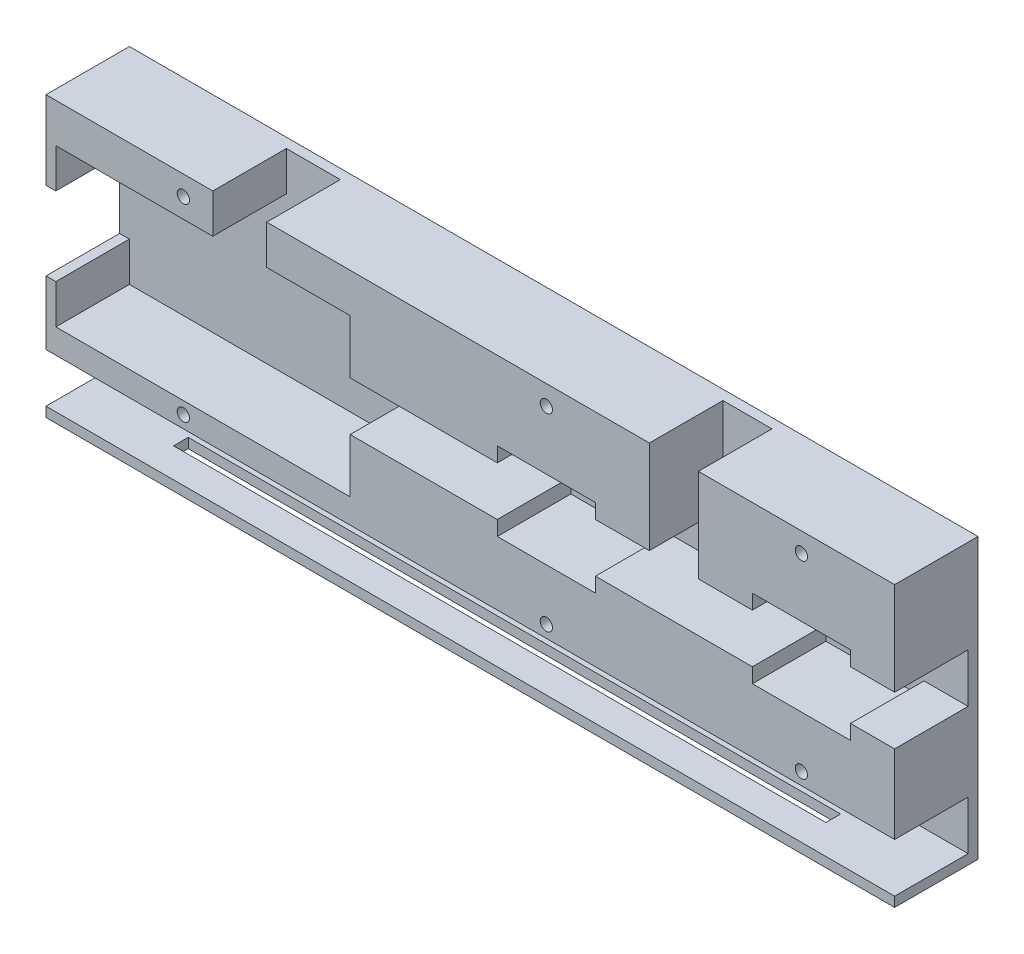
ISO-10303-21;
HEADER;
FILE_DESCRIPTION(('STEP AP214'),'2;1');
FILE_NAME('part.step','',(''),(''),'','','');
FILE_SCHEMA(('AUTOMOTIVE_DESIGN { 1 0 10303 214 1 1 1 1 }'));
ENDSEC;
DATA;
#1=APPLICATION_CONTEXT('core data for automotive mechanical design processes');
#2=APPLICATION_PROTOCOL_DEFINITION('international standard','automotive_design',2000,#1);
#3=PRODUCT_CONTEXT('',#1,'mechanical');
#4=PRODUCT('Part','Part','',(#3));
#5=PRODUCT_RELATED_PRODUCT_CATEGORY('part','',(#4));
#6=PRODUCT_DEFINITION_FORMATION('','',#4);
#7=PRODUCT_DEFINITION_CONTEXT('part definition',#1,'design');
#8=PRODUCT_DEFINITION('design','',#6,#7);
#9=PRODUCT_DEFINITION_SHAPE('','',#8);
#10=(LENGTH_UNIT() NAMED_UNIT(*) SI_UNIT(.MILLI.,.METRE.));
#11=(NAMED_UNIT(*) PLANE_ANGLE_UNIT() SI_UNIT($,.RADIAN.));
#12=(NAMED_UNIT(*) SI_UNIT($,.STERADIAN.) SOLID_ANGLE_UNIT());
#13=UNCERTAINTY_MEASURE_WITH_UNIT(LENGTH_MEASURE(1.E-05),#10,'distance_accuracy_value','');
#14=(GEOMETRIC_REPRESENTATION_CONTEXT(3) GLOBAL_UNCERTAINTY_ASSIGNED_CONTEXT((#13)) GLOBAL_UNIT_ASSIGNED_CONTEXT((#10,
#11,#12)) REPRESENTATION_CONTEXT('',''));
#15=CARTESIAN_POINT('',(0.,0.,0.));
#16=DIRECTION('',(0.,0.,1.));
#17=DIRECTION('',(1.,0.,0.));
#18=AXIS2_PLACEMENT_3D('',#15,#16,#17);
#19=CARTESIAN_POINT('',(0.,0.,15.));
#20=DIRECTION('',(0.,0.,1.));
#21=DIRECTION('',(1.,0.,0.));
#22=AXIS2_PLACEMENT_3D('',#19,#20,#21);
#23=PLANE('',#22);
#24=DIRECTION('',(0.,1.,0.));
#25=VECTOR('',#24,1.);
#26=CARTESIAN_POINT('',(173.,0.,15.));
#27=LINE('',#26,#25);
#28=CARTESIAN_POINT('',(173.,12.,15.));
#29=VERTEX_POINT('',#28);
#30=CARTESIAN_POINT('',(173.,28.,15.));
#31=VERTEX_POINT('',#30);
#32=EDGE_CURVE('E713',#29,#31,#27,.T.);
#33=ORIENTED_EDGE('',*,*,#32,.T.);
#34=DIRECTION('',(-1.,0.,0.));
#35=VECTOR('',#34,1.);
#36=CARTESIAN_POINT('',(0.,28.,15.));
#37=LINE('',#36,#35);
#38=CARTESIAN_POINT('',(164.,28.,15.));
#39=VERTEX_POINT('',#38);
#40=EDGE_CURVE('E731',#31,#39,#37,.T.);
#41=ORIENTED_EDGE('',*,*,#40,.T.);
#42=DIRECTION('',(0.,-1.,0.));
#43=VECTOR('',#42,1.);
#44=CARTESIAN_POINT('',(164.,0.,15.));
#45=LINE('',#44,#43);
#46=CARTESIAN_POINT('',(164.,25.,15.));
#47=VERTEX_POINT('',#46);
#48=EDGE_CURVE('E733',#39,#47,#45,.T.);
#49=ORIENTED_EDGE('',*,*,#48,.T.);
#50=DIRECTION('',(-1.,0.,0.));
#51=VECTOR('',#50,1.);
#52=CARTESIAN_POINT('',(0.,25.,15.));
#53=LINE('',#52,#51);
#54=CARTESIAN_POINT('',(144.,25.,15.));
#55=VERTEX_POINT('',#54);
#56=EDGE_CURVE('E735',#47,#55,#53,.T.);
#57=ORIENTED_EDGE('',*,*,#56,.T.);
#58=DIRECTION('',(0.,1.,0.));
#59=VECTOR('',#58,1.);
#60=CARTESIAN_POINT('',(144.,0.,15.));
#61=LINE('',#60,#59);
#62=CARTESIAN_POINT('',(144.,28.,15.));
#63=VERTEX_POINT('',#62);
#64=EDGE_CURVE('E737',#55,#63,#61,.T.);
#65=ORIENTED_EDGE('',*,*,#64,.T.);
#66=DIRECTION('',(-1.,0.,0.));
#67=VECTOR('',#66,1.);
#68=CARTESIAN_POINT('',(0.,28.,15.));
#69=LINE('',#68,#67);
#70=CARTESIAN_POINT('',(112.,28.,15.));
#71=VERTEX_POINT('',#70);
#72=EDGE_CURVE('E739',#63,#71,#69,.T.);
#73=ORIENTED_EDGE('',*,*,#72,.T.);
#74=DIRECTION('',(0.,-1.,0.));
#75=VECTOR('',#74,1.);
#76=CARTESIAN_POINT('',(112.,0.,15.));
#77=LINE('',#76,#75);
#78=CARTESIAN_POINT('',(112.,25.,15.));
#79=VERTEX_POINT('',#78);
#80=EDGE_CURVE('E741',#71,#79,#77,.T.);
#81=ORIENTED_EDGE('',*,*,#80,.T.);
#82=DIRECTION('',(-1.,0.,0.));
#83=VECTOR('',#82,1.);
#84=CARTESIAN_POINT('',(0.,25.,15.));
#85=LINE('',#84,#83);
#86=CARTESIAN_POINT('',(92.,25.,15.));
#87=VERTEX_POINT('',#86);
#88=EDGE_CURVE('E743',#79,#87,#85,.T.);
#89=ORIENTED_EDGE('',*,*,#88,.T.);
#90=DIRECTION('',(0.,1.,0.));
#91=VECTOR('',#90,1.);
#92=CARTESIAN_POINT('',(92.,0.,15.));
#93=LINE('',#92,#91);
#94=CARTESIAN_POINT('',(92.,28.,15.));
#95=VERTEX_POINT('',#94);
#96=EDGE_CURVE('E745',#87,#95,#93,.T.);
#97=ORIENTED_EDGE('',*,*,#96,.T.);
#98=DIRECTION('',(-1.,0.,0.));
#99=VECTOR('',#98,1.);
#100=CARTESIAN_POINT('',(0.,28.,15.));
#101=LINE('',#100,#99);
#102=CARTESIAN_POINT('',(62.,28.,15.));
#103=VERTEX_POINT('',#102);
#104=EDGE_CURVE('E747',#95,#103,#101,.T.);
#105=ORIENTED_EDGE('',*,*,#104,.T.);
#106=DIRECTION('',(0.,-1.,0.));
#107=VECTOR('',#106,1.);
#108=CARTESIAN_POINT('',(62.,0.,15.));
#109=LINE('',#108,#107);
#110=CARTESIAN_POINT('',(62.,17.,15.));
#111=VERTEX_POINT('',#110);
#112=EDGE_CURVE('E749',#103,#111,#109,.T.);
#113=ORIENTED_EDGE('',*,*,#112,.T.);
#114=DIRECTION('',(-1.,0.,0.));
#115=VECTOR('',#114,1.);
#116=CARTESIAN_POINT('',(0.,17.,15.));
#117=LINE('',#116,#115);
#118=CARTESIAN_POINT('',(2.00000000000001,17.,15.));
#119=VERTEX_POINT('',#118);
#120=EDGE_CURVE('E751',#111,#119,#117,.T.);
#121=ORIENTED_EDGE('',*,*,#120,.T.);
#122=DIRECTION('',(0.,1.,0.));
#123=VECTOR('',#122,1.);
#124=CARTESIAN_POINT('',(2.00000000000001,0.,15.));
#125=LINE('',#124,#123);
#126=CARTESIAN_POINT('',(2.00000000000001,25.,15.));
#127=VERTEX_POINT('',#126);
#128=EDGE_CURVE('E753',#119,#127,#125,.T.);
#129=ORIENTED_EDGE('',*,*,#128,.T.);
#130=DIRECTION('',(-1.,0.,0.));
#131=VECTOR('',#130,1.);
#132=CARTESIAN_POINT('',(0.,25.,15.));
#133=LINE('',#132,#131);
#134=CARTESIAN_POINT('',(0.,25.,15.));
#135=VERTEX_POINT('',#134);
#136=EDGE_CURVE('E755',#127,#135,#133,.T.);
#137=ORIENTED_EDGE('',*,*,#136,.T.);
#138=DIRECTION('',(0.,1.,0.));
#139=VECTOR('',#138,1.);
#140=CARTESIAN_POINT('',(0.,0.,15.));
#141=LINE('',#140,#139);
#142=CARTESIAN_POINT('',(0.,12.,15.));
#143=VERTEX_POINT('',#142);
#144=EDGE_CURVE('E706',#143,#135,#141,.T.);
#145=ORIENTED_EDGE('',*,*,#144,.F.);
#146=DIRECTION('',(1.,0.,0.));
#147=VECTOR('',#146,1.);
#148=CARTESIAN_POINT('',(0.,12.,15.));
#149=LINE('',#148,#147);
#150=EDGE_CURVE('E709',#143,#29,#149,.T.);
#151=ORIENTED_EDGE('',*,*,#150,.T.);
#152=EDGE_LOOP('',(#33,#41,#49,#57,#65,#73,#81,#89,#97,#105,#113,#121,#129,#137,#145,#151));
#153=FACE_BOUND('',#152,.T.);
#154=CARTESIAN_POINT('',(28.,14.5,15.));
#155=DIRECTION('',(0.,0.,1.));
#156=DIRECTION('',(1.,0.,0.));
#157=AXIS2_PLACEMENT_3D('',#154,#155,#156);
#158=CIRCLE('',#157,1.25);
#159=CARTESIAN_POINT('',(29.25,14.5,15.));
#160=VERTEX_POINT('',#159);
#161=EDGE_CURVE('E621',#160,#160,#158,.T.);
#162=ORIENTED_EDGE('',*,*,#161,.F.);
#163=EDGE_LOOP('',(#162));
#164=FACE_BOUND('',#163,.T.);
#165=CARTESIAN_POINT('',(102.,14.5,15.));
#166=DIRECTION('',(0.,0.,1.));
#167=DIRECTION('',(1.,0.,0.));
#168=AXIS2_PLACEMENT_3D('',#165,#166,#167);
#169=CIRCLE('',#168,1.25);
#170=CARTESIAN_POINT('',(103.25,14.5,15.));
#171=VERTEX_POINT('',#170);
#172=EDGE_CURVE('E609',#171,#171,#169,.T.);
#173=ORIENTED_EDGE('',*,*,#172,.F.);
#174=EDGE_LOOP('',(#173));
#175=FACE_BOUND('',#174,.T.);
#176=CARTESIAN_POINT('',(154.,14.5,15.));
#177=DIRECTION('',(0.,0.,1.));
#178=DIRECTION('',(1.,0.,0.));
#179=AXIS2_PLACEMENT_3D('',#176,#177,#178);
#180=CIRCLE('',#179,1.25000000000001);
#181=CARTESIAN_POINT('',(155.25,14.5,15.));
#182=VERTEX_POINT('',#181);
#183=EDGE_CURVE('E602',#182,#182,#180,.T.);
#184=ORIENTED_EDGE('',*,*,#183,.F.);
#185=EDGE_LOOP('',(#184));
#186=FACE_BOUND('',#185,.T.);
#187=ADVANCED_FACE('F226',(#153,#164,#175,#186),#23,.T.);
#188=CARTESIAN_POINT('',(0.,0.,0.));
#189=DIRECTION('',(0.,0.,1.));
#190=DIRECTION('',(1.,0.,0.));
#191=AXIS2_PLACEMENT_3D('',#188,#189,#190);
#192=PLANE('',#191);
#193=DIRECTION('',(1.,0.,0.));
#194=VECTOR('',#193,1.);
#195=CARTESIAN_POINT('',(173.,57.,0.));
#196=LINE('',#195,#194);
#197=CARTESIAN_POINT('',(123.,57.,0.));
#198=VERTEX_POINT('',#197);
#199=CARTESIAN_POINT('',(133.,57.,0.));
#200=VERTEX_POINT('',#199);
#201=EDGE_CURVE('E1057',#198,#200,#196,.T.);
#202=ORIENTED_EDGE('',*,*,#201,.F.);
#203=DIRECTION('',(0.,1.,0.));
#204=VECTOR('',#203,1.);
#205=CARTESIAN_POINT('',(123.,0.,0.));
#206=LINE('',#205,#204);
#207=CARTESIAN_POINT('',(123.,38.,0.));
#208=VERTEX_POINT('',#207);
#209=EDGE_CURVE('E663',#208,#198,#206,.T.);
#210=ORIENTED_EDGE('',*,*,#209,.F.);
#211=DIRECTION('',(1.,0.,0.));
#212=VECTOR('',#211,1.);
#213=CARTESIAN_POINT('',(0.,38.,0.));
#214=LINE('',#213,#212);
#215=CARTESIAN_POINT('',(112.,38.,0.));
#216=VERTEX_POINT('',#215);
#217=EDGE_CURVE('E633',#216,#208,#214,.T.);
#218=ORIENTED_EDGE('',*,*,#217,.F.);
#219=DIRECTION('',(0.,-1.,0.));
#220=VECTOR('',#219,1.);
#221=CARTESIAN_POINT('',(112.,-5.18104078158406E-13,0.));
#222=LINE('',#221,#220);
#223=CARTESIAN_POINT('',(112.,41.,0.));
#224=VERTEX_POINT('',#223);
#225=EDGE_CURVE('E640',#224,#216,#222,.T.);
#226=ORIENTED_EDGE('',*,*,#225,.F.);
#227=DIRECTION('',(1.,0.,0.));
#228=VECTOR('',#227,1.);
#229=CARTESIAN_POINT('',(0.,41.,0.));
#230=LINE('',#229,#228);
#231=CARTESIAN_POINT('',(92.,41.,0.));
#232=VERTEX_POINT('',#231);
#233=EDGE_CURVE('E677',#232,#224,#230,.T.);
#234=ORIENTED_EDGE('',*,*,#233,.F.);
#235=DIRECTION('',(0.,1.,0.));
#236=VECTOR('',#235,1.);
#237=CARTESIAN_POINT('',(92.,0.,0.));
#238=LINE('',#237,#236);
#239=CARTESIAN_POINT('',(92.,38.,0.));
#240=VERTEX_POINT('',#239);
#241=EDGE_CURVE('E675',#240,#232,#238,.T.);
#242=ORIENTED_EDGE('',*,*,#241,.F.);
#243=DIRECTION('',(1.,0.,0.));
#244=VECTOR('',#243,1.);
#245=CARTESIAN_POINT('',(0.,38.,0.));
#246=LINE('',#245,#244);
#247=CARTESIAN_POINT('',(62.,38.,0.));
#248=VERTEX_POINT('',#247);
#249=EDGE_CURVE('E673',#248,#240,#246,.T.);
#250=ORIENTED_EDGE('',*,*,#249,.F.);
#251=DIRECTION('',(0.,-1.,0.));
#252=VECTOR('',#251,1.);
#253=CARTESIAN_POINT('',(62.,0.,0.));
#254=LINE('',#253,#252);
#255=CARTESIAN_POINT('',(62.,49.,0.));
#256=VERTEX_POINT('',#255);
#257=EDGE_CURVE('E671',#256,#248,#254,.T.);
#258=ORIENTED_EDGE('',*,*,#257,.F.);
#259=DIRECTION('',(-1.,0.,0.));
#260=VECTOR('',#259,1.);
#261=CARTESIAN_POINT('',(0.,49.,0.));
#262=LINE('',#261,#260);
#263=CARTESIAN_POINT('',(45.,49.,0.));
#264=VERTEX_POINT('',#263);
#265=EDGE_CURVE('E668',#256,#264,#262,.T.);
#266=ORIENTED_EDGE('',*,*,#265,.T.);
#267=DIRECTION('',(0.,-1.,0.));
#268=VECTOR('',#267,1.);
#269=CARTESIAN_POINT('',(45.,0.,0.));
#270=LINE('',#269,#268);
#271=CARTESIAN_POINT('',(45.,57.,0.));
#272=VERTEX_POINT('',#271);
#273=EDGE_CURVE('E665',#272,#264,#270,.T.);
#274=ORIENTED_EDGE('',*,*,#273,.F.);
#275=CARTESIAN_POINT('',(34.,57.,0.));
#276=VERTEX_POINT('',#275);
#277=EDGE_CURVE('E904',#276,#272,#196,.T.);
#278=ORIENTED_EDGE('',*,*,#277,.F.);
#279=DIRECTION('',(0.,-1.,0.));
#280=VECTOR('',#279,1.);
#281=CARTESIAN_POINT('',(34.,0.,0.));
#282=LINE('',#281,#280);
#283=CARTESIAN_POINT('',(34.,49.,0.));
#284=VERTEX_POINT('',#283);
#285=EDGE_CURVE('E879',#276,#284,#282,.T.);
#286=ORIENTED_EDGE('',*,*,#285,.T.);
#287=DIRECTION('',(-1.,0.,0.));
#288=VECTOR('',#287,1.);
#289=CARTESIAN_POINT('',(0.,49.,0.));
#290=LINE('',#289,#288);
#291=CARTESIAN_POINT('',(2.,49.,0.));
#292=VERTEX_POINT('',#291);
#293=EDGE_CURVE('E857',#284,#292,#290,.T.);
#294=ORIENTED_EDGE('',*,*,#293,.T.);
#295=DIRECTION('',(0.,-1.,0.));
#296=VECTOR('',#295,1.);
#297=CARTESIAN_POINT('',(2.00000000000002,0.,0.));
#298=LINE('',#297,#296);
#299=CARTESIAN_POINT('',(2.00000000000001,41.,0.));
#300=VERTEX_POINT('',#299);
#301=EDGE_CURVE('E862',#292,#300,#298,.T.);
#302=ORIENTED_EDGE('',*,*,#301,.T.);
#303=DIRECTION('',(-1.,0.,0.));
#304=VECTOR('',#303,1.);
#305=CARTESIAN_POINT('',(-1.42247325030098E-13,41.,0.));
#306=LINE('',#305,#304);
#307=CARTESIAN_POINT('',(0.,41.,0.));
#308=VERTEX_POINT('',#307);
#309=EDGE_CURVE('E881',#300,#308,#306,.T.);
#310=ORIENTED_EDGE('',*,*,#309,.T.);
#311=DIRECTION('',(0.,1.,0.));
#312=VECTOR('',#311,1.);
#313=CARTESIAN_POINT('',(0.,0.,0.));
#314=LINE('',#313,#312);
#315=CARTESIAN_POINT('',(0.,25.,0.));
#316=VERTEX_POINT('',#315);
#317=EDGE_CURVE('E919',#316,#308,#314,.T.);
#318=ORIENTED_EDGE('',*,*,#317,.F.);
#319=DIRECTION('',(-1.,0.,0.));
#320=VECTOR('',#319,1.);
#321=CARTESIAN_POINT('',(0.,25.,0.));
#322=LINE('',#321,#320);
#323=CARTESIAN_POINT('',(2.00000000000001,25.,0.));
#324=VERTEX_POINT('',#323);
#325=EDGE_CURVE('E710',#324,#316,#322,.T.);
#326=ORIENTED_EDGE('',*,*,#325,.F.);
#327=DIRECTION('',(0.,1.,0.));
#328=VECTOR('',#327,1.);
#329=CARTESIAN_POINT('',(2.00000000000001,0.,0.));
#330=LINE('',#329,#328);
#331=CARTESIAN_POINT('',(2.00000000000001,17.,0.));
#332=VERTEX_POINT('',#331);
#333=EDGE_CURVE('E793',#332,#324,#330,.T.);
#334=ORIENTED_EDGE('',*,*,#333,.F.);
#335=DIRECTION('',(-1.,0.,0.));
#336=VECTOR('',#335,1.);
#337=CARTESIAN_POINT('',(0.,17.,0.));
#338=LINE('',#337,#336);
#339=CARTESIAN_POINT('',(62.,17.,0.));
#340=VERTEX_POINT('',#339);
#341=EDGE_CURVE('E791',#340,#332,#338,.T.);
#342=ORIENTED_EDGE('',*,*,#341,.F.);
#343=DIRECTION('',(0.,-1.,0.));
#344=VECTOR('',#343,1.);
#345=CARTESIAN_POINT('',(62.,0.,0.));
#346=LINE('',#345,#344);
#347=CARTESIAN_POINT('',(62.,28.,0.));
#348=VERTEX_POINT('',#347);
#349=EDGE_CURVE('E789',#348,#340,#346,.T.);
#350=ORIENTED_EDGE('',*,*,#349,.F.);
#351=DIRECTION('',(-1.,0.,0.));
#352=VECTOR('',#351,1.);
#353=CARTESIAN_POINT('',(0.,28.,0.));
#354=LINE('',#353,#352);
#355=CARTESIAN_POINT('',(92.,28.,0.));
#356=VERTEX_POINT('',#355);
#357=EDGE_CURVE('E787',#356,#348,#354,.T.);
#358=ORIENTED_EDGE('',*,*,#357,.F.);
#359=DIRECTION('',(0.,1.,0.));
#360=VECTOR('',#359,1.);
#361=CARTESIAN_POINT('',(92.,0.,0.));
#362=LINE('',#361,#360);
#363=CARTESIAN_POINT('',(92.,25.,0.));
#364=VERTEX_POINT('',#363);
#365=EDGE_CURVE('E785',#364,#356,#362,.T.);
#366=ORIENTED_EDGE('',*,*,#365,.F.);
#367=DIRECTION('',(-1.,0.,0.));
#368=VECTOR('',#367,1.);
#369=CARTESIAN_POINT('',(0.,25.,0.));
#370=LINE('',#369,#368);
#371=CARTESIAN_POINT('',(112.,25.,0.));
#372=VERTEX_POINT('',#371);
#373=EDGE_CURVE('E783',#372,#364,#370,.T.);
#374=ORIENTED_EDGE('',*,*,#373,.F.);
#375=DIRECTION('',(0.,-1.,0.));
#376=VECTOR('',#375,1.);
#377=CARTESIAN_POINT('',(112.,0.,0.));
#378=LINE('',#377,#376);
#379=CARTESIAN_POINT('',(112.,28.,0.));
#380=VERTEX_POINT('',#379);
#381=EDGE_CURVE('E781',#380,#372,#378,.T.);
#382=ORIENTED_EDGE('',*,*,#381,.F.);
#383=DIRECTION('',(-1.,0.,0.));
#384=VECTOR('',#383,1.);
#385=CARTESIAN_POINT('',(0.,28.,0.));
#386=LINE('',#385,#384);
#387=CARTESIAN_POINT('',(144.,28.,0.));
#388=VERTEX_POINT('',#387);
#389=EDGE_CURVE('E779',#388,#380,#386,.T.);
#390=ORIENTED_EDGE('',*,*,#389,.F.);
#391=DIRECTION('',(0.,1.,0.));
#392=VECTOR('',#391,1.);
#393=CARTESIAN_POINT('',(144.,0.,0.));
#394=LINE('',#393,#392);
#395=CARTESIAN_POINT('',(144.,25.,0.));
#396=VERTEX_POINT('',#395);
#397=EDGE_CURVE('E777',#396,#388,#394,.T.);
#398=ORIENTED_EDGE('',*,*,#397,.F.);
#399=DIRECTION('',(-1.,0.,0.));
#400=VECTOR('',#399,1.);
#401=CARTESIAN_POINT('',(0.,25.,0.));
#402=LINE('',#401,#400);
#403=CARTESIAN_POINT('',(164.,25.,0.));
#404=VERTEX_POINT('',#403);
#405=EDGE_CURVE('E775',#404,#396,#402,.T.);
#406=ORIENTED_EDGE('',*,*,#405,.F.);
#407=DIRECTION('',(0.,-1.,0.));
#408=VECTOR('',#407,1.);
#409=CARTESIAN_POINT('',(164.,0.,0.));
#410=LINE('',#409,#408);
#411=CARTESIAN_POINT('',(164.,28.,0.));
#412=VERTEX_POINT('',#411);
#413=EDGE_CURVE('E773',#412,#404,#410,.T.);
#414=ORIENTED_EDGE('',*,*,#413,.F.);
#415=DIRECTION('',(-1.,0.,0.));
#416=VECTOR('',#415,1.);
#417=CARTESIAN_POINT('',(0.,28.,0.));
#418=LINE('',#417,#416);
#419=CARTESIAN_POINT('',(173.,28.,0.));
#420=VERTEX_POINT('',#419);
#421=EDGE_CURVE('E771',#420,#412,#418,.T.);
#422=ORIENTED_EDGE('',*,*,#421,.F.);
#423=DIRECTION('',(0.,1.,0.));
#424=VECTOR('',#423,1.);
#425=CARTESIAN_POINT('',(173.,38.,0.));
#426=LINE('',#425,#424);
#427=CARTESIAN_POINT('',(173.,38.,0.));
#428=VERTEX_POINT('',#427);
#429=EDGE_CURVE('E567',#420,#428,#426,.T.);
#430=ORIENTED_EDGE('',*,*,#429,.T.);
#431=DIRECTION('',(1.,0.,0.));
#432=VECTOR('',#431,1.);
#433=CARTESIAN_POINT('',(0.,38.,0.));
#434=LINE('',#433,#432);
#435=CARTESIAN_POINT('',(164.,38.,0.));
#436=VERTEX_POINT('',#435);
#437=EDGE_CURVE('E769',#436,#428,#434,.T.);
#438=ORIENTED_EDGE('',*,*,#437,.F.);
#439=DIRECTION('',(0.,-1.,0.));
#440=VECTOR('',#439,1.);
#441=CARTESIAN_POINT('',(164.,0.,0.));
#442=LINE('',#441,#440);
#443=CARTESIAN_POINT('',(164.,41.,0.));
#444=VERTEX_POINT('',#443);
#445=EDGE_CURVE('E767',#444,#436,#442,.T.);
#446=ORIENTED_EDGE('',*,*,#445,.F.);
#447=DIRECTION('',(1.,0.,0.));
#448=VECTOR('',#447,1.);
#449=CARTESIAN_POINT('',(0.,41.,0.));
#450=LINE('',#449,#448);
#451=CARTESIAN_POINT('',(144.,41.,0.));
#452=VERTEX_POINT('',#451);
#453=EDGE_CURVE('E765',#452,#444,#450,.T.);
#454=ORIENTED_EDGE('',*,*,#453,.F.);
#455=DIRECTION('',(0.,1.,0.));
#456=VECTOR('',#455,1.);
#457=CARTESIAN_POINT('',(144.,0.,0.));
#458=LINE('',#457,#456);
#459=CARTESIAN_POINT('',(144.,38.,0.));
#460=VERTEX_POINT('',#459);
#461=EDGE_CURVE('E763',#460,#452,#458,.T.);
#462=ORIENTED_EDGE('',*,*,#461,.F.);
#463=DIRECTION('',(1.,0.,0.));
#464=VECTOR('',#463,1.);
#465=CARTESIAN_POINT('',(0.,38.,0.));
#466=LINE('',#465,#464);
#467=CARTESIAN_POINT('',(133.,38.,0.));
#468=VERTEX_POINT('',#467);
#469=EDGE_CURVE('E761',#468,#460,#466,.T.);
#470=ORIENTED_EDGE('',*,*,#469,.F.);
#471=DIRECTION('',(0.,-1.,0.));
#472=VECTOR('',#471,1.);
#473=CARTESIAN_POINT('',(133.,0.,0.));
#474=LINE('',#473,#472);
#475=EDGE_CURVE('E759',#200,#468,#474,.T.);
#476=ORIENTED_EDGE('',*,*,#475,.F.);
#477=EDGE_LOOP('',(#202,#210,#218,#226,#234,#242,#250,#258,#266,#274,#278,#286,#294,#302,#310,
#318,#326,#334,#342,#350,#358,#366,#374,#382,#390,#398,#406,#414,#422,#430,#438,#446,#454,#462,
#470,#476));
#478=FACE_BOUND('',#477,.T.);
#479=ADVANCED_FACE('F951',(#478),#192,.T.);
#480=CARTESIAN_POINT('',(146.281572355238,4.5,0.));
#481=DIRECTION('',(0.,0.,1.));
#482=DIRECTION('',(1.,0.,0.));
#483=AXIS2_PLACEMENT_3D('',#480,#481,#482);
#484=CIRCLE('',#483,1.25000000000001);
#485=CARTESIAN_POINT('',(147.531572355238,4.5,0.));
#486=VERTEX_POINT('',#485);
#487=EDGE_CURVE('E574',#486,#486,#484,.T.);
#488=ORIENTED_EDGE('',*,*,#487,.F.);
#489=EDGE_LOOP('',(#488));
#490=FACE_BOUND('',#489,.T.);
#491=CARTESIAN_POINT('',(161.869773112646,9.5,0.));
#492=DIRECTION('',(0.,0.,1.));
#493=DIRECTION('',(1.,0.,0.));
#494=AXIS2_PLACEMENT_3D('',#491,#492,#493);
#495=CIRCLE('',#494,1.25000000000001);
#496=CARTESIAN_POINT('',(163.119773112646,9.5,0.));
#497=VERTEX_POINT('',#496);
#498=EDGE_CURVE('E579',#497,#497,#495,.T.);
#499=ORIENTED_EDGE('',*,*,#498,.F.);
#500=EDGE_LOOP('',(#499));
#501=FACE_BOUND('',#500,.T.);
#502=CARTESIAN_POINT('',(112.564871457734,4.5,0.));
#503=DIRECTION('',(0.,0.,1.));
#504=DIRECTION('',(1.,0.,0.));
#505=AXIS2_PLACEMENT_3D('',#502,#503,#504);
#506=CIRCLE('',#505,1.25);
#507=CARTESIAN_POINT('',(113.814871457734,4.5,0.));
#508=VERTEX_POINT('',#507);
#509=EDGE_CURVE('E583',#508,#508,#506,.T.);
#510=ORIENTED_EDGE('',*,*,#509,.F.);
#511=EDGE_LOOP('',(#510));
#512=FACE_BOUND('',#511,.T.);
#513=CARTESIAN_POINT('',(99.1705656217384,9.5,0.));
#514=DIRECTION('',(0.,0.,1.));
#515=DIRECTION('',(1.,0.,0.));
#516=AXIS2_PLACEMENT_3D('',#513,#514,#515);
#517=CIRCLE('',#516,1.25);
#518=CARTESIAN_POINT('',(100.420565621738,9.5,0.));
#519=VERTEX_POINT('',#518);
#520=EDGE_CURVE('E587',#519,#519,#517,.T.);
#521=ORIENTED_EDGE('',*,*,#520,.F.);
#522=EDGE_LOOP('',(#521));
#523=FACE_BOUND('',#522,.T.);
#524=CARTESIAN_POINT('',(63.0290334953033,4.5,0.));
#525=DIRECTION('',(0.,0.,1.));
#526=DIRECTION('',(1.,0.,0.));
#527=AXIS2_PLACEMENT_3D('',#524,#525,#526);
#528=CIRCLE('',#527,1.25);
#529=CARTESIAN_POINT('',(64.2790334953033,4.5,0.));
#530=VERTEX_POINT('',#529);
#531=EDGE_CURVE('E591',#530,#530,#528,.T.);
#532=ORIENTED_EDGE('',*,*,#531,.F.);
#533=EDGE_LOOP('',(#532));
#534=FACE_BOUND('',#533,.T.);
#535=CARTESIAN_POINT('',(46.1706830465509,9.5,0.));
#536=DIRECTION('',(0.,0.,1.));
#537=DIRECTION('',(1.,0.,0.));
#538=AXIS2_PLACEMENT_3D('',#535,#536,#537);
#539=CIRCLE('',#538,1.25);
#540=CARTESIAN_POINT('',(47.4206830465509,9.5,0.));
#541=VERTEX_POINT('',#540);
#542=EDGE_CURVE('E595',#541,#541,#539,.T.);
#543=ORIENTED_EDGE('',*,*,#542,.F.);
#544=EDGE_LOOP('',(#543));
#545=FACE_BOUND('',#544,.T.);
#546=DIRECTION('',(0.,-1.,0.));
#547=VECTOR('',#546,1.);
#548=CARTESIAN_POINT('',(173.,0.,0.));
#549=LINE('',#548,#547);
#550=CARTESIAN_POINT('',(173.,12.,0.));
#551=VERTEX_POINT('',#550);
#552=CARTESIAN_POINT('',(173.,2.,0.));
#553=VERTEX_POINT('',#552);
#554=EDGE_CURVE('E899',#551,#553,#549,.T.);
#555=ORIENTED_EDGE('',*,*,#554,.F.);
#556=DIRECTION('',(1.,0.,0.));
#557=VECTOR('',#556,1.);
#558=CARTESIAN_POINT('',(0.,12.,0.));
#559=LINE('',#558,#557);
#560=CARTESIAN_POINT('',(0.,12.,0.));
#561=VERTEX_POINT('',#560);
#562=EDGE_CURVE('E705',#561,#551,#559,.T.);
#563=ORIENTED_EDGE('',*,*,#562,.F.);
#564=CARTESIAN_POINT('',(0.,2.,0.));
#565=VERTEX_POINT('',#564);
#566=EDGE_CURVE('E1061',#565,#561,#314,.T.);
#567=ORIENTED_EDGE('',*,*,#566,.F.);
#568=DIRECTION('',(1.,0.,0.));
#569=VECTOR('',#568,1.);
#570=CARTESIAN_POINT('',(0.,2.,0.));
#571=LINE('',#570,#569);
#572=EDGE_CURVE('E1069',#565,#553,#571,.T.);
#573=ORIENTED_EDGE('',*,*,#572,.T.);
#574=EDGE_LOOP('',(#555,#563,#567,#573));
#575=FACE_BOUND('',#574,.T.);
#576=ADVANCED_FACE('F958',(#490,#501,#512,#523,#534,#545,#575),#192,.T.);
#577=CARTESIAN_POINT('',(0.,2.,15.));
#578=DIRECTION('',(0.,1.,0.));
#579=DIRECTION('',(0.,0.,1.));
#580=AXIS2_PLACEMENT_3D('',#577,#578,#579);
#581=PLANE('',#580);
#582=DIRECTION('',(0.,0.,1.));
#583=VECTOR('',#582,1.);
#584=CARTESIAN_POINT('',(20.,2.,15.));
#585=LINE('',#584,#583);
#586=CARTESIAN_POINT('',(20.,2.,6.));
#587=VERTEX_POINT('',#586);
#588=CARTESIAN_POINT('',(20.,2.,9.));
#589=VERTEX_POINT('',#588);
#590=EDGE_CURVE('E565',#587,#589,#585,.T.);
#591=ORIENTED_EDGE('',*,*,#590,.F.);
#592=DIRECTION('',(-1.,0.,0.));
#593=VECTOR('',#592,1.);
#594=CARTESIAN_POINT('',(0.,2.,6.));
#595=LINE('',#594,#593);
#596=CARTESIAN_POINT('',(153.,2.,6.));
#597=VERTEX_POINT('',#596);
#598=EDGE_CURVE('E558',#597,#587,#595,.T.);
#599=ORIENTED_EDGE('',*,*,#598,.F.);
#600=DIRECTION('',(0.,0.,-1.));
#601=VECTOR('',#600,1.);
#602=CARTESIAN_POINT('',(153.,2.,15.));
#603=LINE('',#602,#601);
#604=CARTESIAN_POINT('',(153.,2.,9.));
#605=VERTEX_POINT('',#604);
#606=EDGE_CURVE('E538',#605,#597,#603,.T.);
#607=ORIENTED_EDGE('',*,*,#606,.F.);
#608=DIRECTION('',(1.,0.,0.));
#609=VECTOR('',#608,1.);
#610=CARTESIAN_POINT('',(0.,2.,9.));
#611=LINE('',#610,#609);
#612=EDGE_CURVE('E563',#589,#605,#611,.T.);
#613=ORIENTED_EDGE('',*,*,#612,.F.);
#614=EDGE_LOOP('',(#591,#599,#607,#613));
#615=FACE_BOUND('',#614,.T.);
#616=ORIENTED_EDGE('',*,*,#572,.F.);
#617=DIRECTION('',(0.,0.,-1.));
#618=VECTOR('',#617,1.);
#619=CARTESIAN_POINT('',(0.,2.,15.));
#620=LINE('',#619,#618);
#621=CARTESIAN_POINT('',(0.,2.,15.));
#622=VERTEX_POINT('',#621);
#623=EDGE_CURVE('E12',#622,#565,#620,.T.);
#624=ORIENTED_EDGE('',*,*,#623,.F.);
#625=DIRECTION('',(1.,0.,0.));
#626=VECTOR('',#625,1.);
#627=CARTESIAN_POINT('',(0.,2.,15.));
#628=LINE('',#627,#626);
#629=CARTESIAN_POINT('',(173.,2.,15.));
#630=VERTEX_POINT('',#629);
#631=EDGE_CURVE('E1071',#622,#630,#628,.T.);
#632=ORIENTED_EDGE('',*,*,#631,.T.);
#633=DIRECTION('',(0.,0.,-1.));
#634=VECTOR('',#633,1.);
#635=CARTESIAN_POINT('',(173.,2.,15.));
#636=LINE('',#635,#634);
#637=EDGE_CURVE('E1081',#630,#553,#636,.T.);
#638=ORIENTED_EDGE('',*,*,#637,.T.);
#639=EDGE_LOOP('',(#616,#624,#632,#638));
#640=FACE_BOUND('',#639,.T.);
#641=ADVANCED_FACE('F228',(#615,#640),#581,.T.);
#642=CARTESIAN_POINT('',(0.,0.,15.));
#643=DIRECTION('',(-1.,0.,0.));
#644=DIRECTION('',(0.,0.,1.));
#645=AXIS2_PLACEMENT_3D('',#642,#643,#644);
#646=PLANE('',#645);
#647=ORIENTED_EDGE('',*,*,#623,.T.);
#648=ORIENTED_EDGE('',*,*,#566,.T.);
#649=DIRECTION('',(0.,0.,-1.));
#650=VECTOR('',#649,1.);
#651=CARTESIAN_POINT('',(0.,12.,15.));
#652=LINE('',#651,#650);
#653=EDGE_CURVE('E855',#143,#561,#652,.T.);
#654=ORIENTED_EDGE('',*,*,#653,.F.);
#655=ORIENTED_EDGE('',*,*,#144,.T.);
#656=DIRECTION('',(0.,0.,-1.));
#657=VECTOR('',#656,1.);
#658=CARTESIAN_POINT('',(0.,25.,15.));
#659=LINE('',#658,#657);
#660=EDGE_CURVE('E757',#135,#316,#659,.T.);
#661=ORIENTED_EDGE('',*,*,#660,.T.);
#662=ORIENTED_EDGE('',*,*,#317,.T.);
#663=DIRECTION('',(0.,0.,-1.));
#664=VECTOR('',#663,1.);
#665=CARTESIAN_POINT('',(0.,41.,15.));
#666=LINE('',#665,#664);
#667=CARTESIAN_POINT('',(0.,41.,15.));
#668=VERTEX_POINT('',#667);
#669=EDGE_CURVE('E890',#668,#308,#666,.T.);
#670=ORIENTED_EDGE('',*,*,#669,.F.);
#671=DIRECTION('',(0.,1.,0.));
#672=VECTOR('',#671,1.);
#673=CARTESIAN_POINT('',(0.,0.,15.));
#674=LINE('',#673,#672);
#675=CARTESIAN_POINT('',(0.,57.,15.));
#676=VERTEX_POINT('',#675);
#677=EDGE_CURVE('E868',#668,#676,#674,.T.);
#678=ORIENTED_EDGE('',*,*,#677,.T.);
#679=DIRECTION('',(0.,0.,1.));
#680=VECTOR('',#679,1.);
#681=CARTESIAN_POINT('',(0.,57.,-2.));
#682=LINE('',#681,#680);
#683=CARTESIAN_POINT('',(0.,57.,-2.));
#684=VERTEX_POINT('',#683);
#685=EDGE_CURVE('E1068',#684,#676,#682,.T.);
#686=ORIENTED_EDGE('',*,*,#685,.F.);
#687=DIRECTION('',(0.,1.,0.));
#688=VECTOR('',#687,1.);
#689=CARTESIAN_POINT('',(0.,0.,-2.));
#690=LINE('',#689,#688);
#691=CARTESIAN_POINT('',(0.,0.,-2.));
#692=VERTEX_POINT('',#691);
#693=EDGE_CURVE('E907',#692,#684,#690,.T.);
#694=ORIENTED_EDGE('',*,*,#693,.F.);
#695=DIRECTION('',(0.,0.,-1.));
#696=VECTOR('',#695,1.);
#697=CARTESIAN_POINT('',(0.,0.,15.));
#698=LINE('',#697,#696);
#699=CARTESIAN_POINT('',(0.,0.,15.));
#700=VERTEX_POINT('',#699);
#701=EDGE_CURVE('E235',#700,#692,#698,.T.);
#702=ORIENTED_EDGE('',*,*,#701,.F.);
#703=DIRECTION('',(0.,1.,0.));
#704=VECTOR('',#703,1.);
#705=CARTESIAN_POINT('',(0.,0.,15.));
#706=LINE('',#705,#704);
#707=EDGE_CURVE('E1074',#700,#622,#706,.T.);
#708=ORIENTED_EDGE('',*,*,#707,.T.);
#709=EDGE_LOOP('',(#647,#648,#654,#655,#661,#662,#670,#678,#686,#694,#702,#708));
#710=FACE_BOUND('',#709,.T.);
#711=ADVANCED_FACE('F1107',(#710),#646,.T.);
#712=CARTESIAN_POINT('',(0.,0.,15.));
#713=DIRECTION('',(0.,1.,0.));
#714=DIRECTION('',(0.,0.,1.));
#715=AXIS2_PLACEMENT_3D('',#712,#713,#714);
#716=PLANE('',#715);
#717=DIRECTION('',(1.,0.,0.));
#718=VECTOR('',#717,1.);
#719=CARTESIAN_POINT('',(20.,0.,6.));
#720=LINE('',#719,#718);
#721=CARTESIAN_POINT('',(20.,0.,6.));
#722=VERTEX_POINT('',#721);
#723=CARTESIAN_POINT('',(153.,0.,6.));
#724=VERTEX_POINT('',#723);
#725=EDGE_CURVE('E544',#722,#724,#720,.T.);
#726=ORIENTED_EDGE('',*,*,#725,.F.);
#727=DIRECTION('',(0.,0.,-1.));
#728=VECTOR('',#727,1.);
#729=CARTESIAN_POINT('',(20.,0.,6.));
#730=LINE('',#729,#728);
#731=CARTESIAN_POINT('',(20.,0.,9.));
#732=VERTEX_POINT('',#731);
#733=EDGE_CURVE('E251',#732,#722,#730,.T.);
#734=ORIENTED_EDGE('',*,*,#733,.F.);
#735=DIRECTION('',(-1.,0.,0.));
#736=VECTOR('',#735,1.);
#737=CARTESIAN_POINT('',(20.,0.,9.));
#738=LINE('',#737,#736);
#739=CARTESIAN_POINT('',(153.,0.,9.));
#740=VERTEX_POINT('',#739);
#741=EDGE_CURVE('E551',#740,#732,#738,.T.);
#742=ORIENTED_EDGE('',*,*,#741,.F.);
#743=DIRECTION('',(0.,0.,1.));
#744=VECTOR('',#743,1.);
#745=CARTESIAN_POINT('',(153.,0.,6.));
#746=LINE('',#745,#744);
#747=EDGE_CURVE('E535',#724,#740,#746,.T.);
#748=ORIENTED_EDGE('',*,*,#747,.F.);
#749=EDGE_LOOP('',(#726,#734,#742,#748));
#750=FACE_BOUND('',#749,.T.);
#751=ORIENTED_EDGE('',*,*,#701,.T.);
#752=DIRECTION('',(-1.,0.,0.));
#753=VECTOR('',#752,1.);
#754=CARTESIAN_POINT('',(173.,0.,-2.));
#755=LINE('',#754,#753);
#756=CARTESIAN_POINT('',(173.,0.,-2.));
#757=VERTEX_POINT('',#756);
#758=EDGE_CURVE('E903',#757,#692,#755,.T.);
#759=ORIENTED_EDGE('',*,*,#758,.F.);
#760=DIRECTION('',(0.,0.,-1.));
#761=VECTOR('',#760,1.);
#762=CARTESIAN_POINT('',(173.,0.,15.));
#763=LINE('',#762,#761);
#764=CARTESIAN_POINT('',(173.,0.,15.));
#765=VERTEX_POINT('',#764);
#766=EDGE_CURVE('E1084',#765,#757,#763,.T.);
#767=ORIENTED_EDGE('',*,*,#766,.F.);
#768=DIRECTION('',(1.,0.,0.));
#769=VECTOR('',#768,1.);
#770=CARTESIAN_POINT('',(0.,0.,15.));
#771=LINE('',#770,#769);
#772=EDGE_CURVE('E1077',#700,#765,#771,.T.);
#773=ORIENTED_EDGE('',*,*,#772,.F.);
#774=EDGE_LOOP('',(#751,#759,#767,#773));
#775=FACE_BOUND('',#774,.T.);
#776=ADVANCED_FACE('F548',(#750,#775),#716,.F.);
#777=CARTESIAN_POINT('',(173.,0.,15.));
#778=DIRECTION('',(-1.,0.,0.));
#779=DIRECTION('',(0.,0.,1.));
#780=AXIS2_PLACEMENT_3D('',#777,#778,#779);
#781=PLANE('',#780);
#782=ORIENTED_EDGE('',*,*,#429,.F.);
#783=DIRECTION('',(0.,0.,1.));
#784=VECTOR('',#783,1.);
#785=CARTESIAN_POINT('',(173.,28.,0.));
#786=LINE('',#785,#784);
#787=EDGE_CURVE('E570',#420,#31,#786,.T.);
#788=ORIENTED_EDGE('',*,*,#787,.T.);
#789=ORIENTED_EDGE('',*,*,#32,.F.);
#790=DIRECTION('',(0.,0.,-1.));
#791=VECTOR('',#790,1.);
#792=CARTESIAN_POINT('',(173.,12.,15.));
#793=LINE('',#792,#791);
#794=EDGE_CURVE('E852',#29,#551,#793,.T.);
#795=ORIENTED_EDGE('',*,*,#794,.T.);
#796=ORIENTED_EDGE('',*,*,#554,.T.);
#797=ORIENTED_EDGE('',*,*,#637,.F.);
#798=DIRECTION('',(0.,1.,0.));
#799=VECTOR('',#798,1.);
#800=CARTESIAN_POINT('',(173.,0.,15.));
#801=LINE('',#800,#799);
#802=EDGE_CURVE('E1079',#765,#630,#801,.T.);
#803=ORIENTED_EDGE('',*,*,#802,.F.);
#804=ORIENTED_EDGE('',*,*,#766,.T.);
#805=DIRECTION('',(0.,-1.,0.));
#806=VECTOR('',#805,1.);
#807=CARTESIAN_POINT('',(173.,0.,-2.));
#808=LINE('',#807,#806);
#809=CARTESIAN_POINT('',(173.,57.,-2.));
#810=VERTEX_POINT('',#809);
#811=EDGE_CURVE('E900',#810,#757,#808,.T.);
#812=ORIENTED_EDGE('',*,*,#811,.F.);
#813=DIRECTION('',(0.,0.,1.));
#814=VECTOR('',#813,1.);
#815=CARTESIAN_POINT('',(173.,57.,-2.));
#816=LINE('',#815,#814);
#817=CARTESIAN_POINT('',(173.,57.,15.));
#818=VERTEX_POINT('',#817);
#819=EDGE_CURVE('E911',#810,#818,#816,.T.);
#820=ORIENTED_EDGE('',*,*,#819,.T.);
#821=CARTESIAN_POINT('',(173.,38.,15.));
#822=VERTEX_POINT('',#821);
#823=EDGE_CURVE('E712',#822,#818,#27,.T.);
#824=ORIENTED_EDGE('',*,*,#823,.F.);
#825=DIRECTION('',(0.,0.,1.));
#826=VECTOR('',#825,1.);
#827=CARTESIAN_POINT('',(173.,38.,0.));
#828=LINE('',#827,#826);
#829=EDGE_CURVE('E571',#428,#822,#828,.T.);
#830=ORIENTED_EDGE('',*,*,#829,.F.);
#831=EDGE_LOOP('',(#782,#788,#789,#795,#796,#797,#803,#804,#812,#820,#824,#830));
#832=FACE_BOUND('',#831,.T.);
#833=ADVANCED_FACE('F1115',(#832),#781,.F.);
#834=CARTESIAN_POINT('',(0.,0.,15.));
#835=DIRECTION('',(0.,0.,1.));
#836=DIRECTION('',(1.,0.,0.));
#837=AXIS2_PLACEMENT_3D('',#834,#835,#836);
#838=PLANE('',#837);
#839=ORIENTED_EDGE('',*,*,#631,.F.);
#840=ORIENTED_EDGE('',*,*,#707,.F.);
#841=ORIENTED_EDGE('',*,*,#772,.T.);
#842=ORIENTED_EDGE('',*,*,#802,.T.);
#843=EDGE_LOOP('',(#839,#840,#841,#842));
#844=FACE_BOUND('',#843,.T.);
#845=ADVANCED_FACE('F1118',(#844),#838,.T.);
#846=CARTESIAN_POINT('',(173.,57.,-2.));
#847=DIRECTION('',(0.,-1.,0.));
#848=DIRECTION('',(0.,0.,-1.));
#849=AXIS2_PLACEMENT_3D('',#846,#847,#848);
#850=PLANE('',#849);
#851=ORIENTED_EDGE('',*,*,#685,.T.);
#852=DIRECTION('',(1.,0.,0.));
#853=VECTOR('',#852,1.);
#854=CARTESIAN_POINT('',(0.,57.,15.));
#855=LINE('',#854,#853);
#856=CARTESIAN_POINT('',(34.,57.,15.));
#857=VERTEX_POINT('',#856);
#858=EDGE_CURVE('E865',#676,#857,#855,.T.);
#859=ORIENTED_EDGE('',*,*,#858,.T.);
#860=DIRECTION('',(0.,0.,-1.));
#861=VECTOR('',#860,1.);
#862=CARTESIAN_POINT('',(34.,57.,15.));
#863=LINE('',#862,#861);
#864=EDGE_CURVE('E893',#857,#276,#863,.T.);
#865=ORIENTED_EDGE('',*,*,#864,.T.);
#866=ORIENTED_EDGE('',*,*,#277,.T.);
#867=DIRECTION('',(0.,0.,-1.));
#868=VECTOR('',#867,1.);
#869=CARTESIAN_POINT('',(45.,57.,15.));
#870=LINE('',#869,#868);
#871=CARTESIAN_POINT('',(45.,57.,15.));
#872=VERTEX_POINT('',#871);
#873=EDGE_CURVE('E698',#872,#272,#870,.T.);
#874=ORIENTED_EDGE('',*,*,#873,.F.);
#875=DIRECTION('',(1.,0.,0.));
#876=VECTOR('',#875,1.);
#877=CARTESIAN_POINT('',(0.,57.,15.));
#878=LINE('',#877,#876);
#879=CARTESIAN_POINT('',(123.,57.,15.));
#880=VERTEX_POINT('',#879);
#881=EDGE_CURVE('E642',#872,#880,#878,.T.);
#882=ORIENTED_EDGE('',*,*,#881,.T.);
#883=DIRECTION('',(0.,0.,-1.));
#884=VECTOR('',#883,1.);
#885=CARTESIAN_POINT('',(123.,57.,15.));
#886=LINE('',#885,#884);
#887=EDGE_CURVE('E700',#880,#198,#886,.T.);
#888=ORIENTED_EDGE('',*,*,#887,.T.);
#889=ORIENTED_EDGE('',*,*,#201,.T.);
#890=DIRECTION('',(0.,0.,-1.));
#891=VECTOR('',#890,1.);
#892=CARTESIAN_POINT('',(133.,57.,15.));
#893=LINE('',#892,#891);
#894=CARTESIAN_POINT('',(133.,57.,15.));
#895=VERTEX_POINT('',#894);
#896=EDGE_CURVE('E849',#895,#200,#893,.T.);
#897=ORIENTED_EDGE('',*,*,#896,.F.);
#898=DIRECTION('',(1.,0.,0.));
#899=VECTOR('',#898,1.);
#900=CARTESIAN_POINT('',(0.,57.,15.));
#901=LINE('',#900,#899);
#902=EDGE_CURVE('E716',#895,#818,#901,.T.);
#903=ORIENTED_EDGE('',*,*,#902,.T.);
#904=ORIENTED_EDGE('',*,*,#819,.F.);
#905=DIRECTION('',(1.,0.,0.));
#906=VECTOR('',#905,1.);
#907=CARTESIAN_POINT('',(173.,57.,-2.));
#908=LINE('',#907,#906);
#909=EDGE_CURVE('E909',#684,#810,#908,.T.);
#910=ORIENTED_EDGE('',*,*,#909,.F.);
#911=EDGE_LOOP('',(#851,#859,#865,#866,#874,#882,#888,#889,#897,#903,#904,#910));
#912=FACE_BOUND('',#911,.T.);
#913=ADVANCED_FACE('F1056',(#912),#850,.F.);
#914=CARTESIAN_POINT('',(0.,0.,-2.));
#915=DIRECTION('',(0.,0.,1.));
#916=DIRECTION('',(1.,0.,0.));
#917=AXIS2_PLACEMENT_3D('',#914,#915,#916);
#918=PLANE('',#917);
#919=CARTESIAN_POINT('',(146.281572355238,4.5,-2.));
#920=DIRECTION('',(0.,0.,1.));
#921=DIRECTION('',(1.,0.,0.));
#922=AXIS2_PLACEMENT_3D('',#919,#920,#921);
#923=CIRCLE('',#922,1.25000000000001);
#924=CARTESIAN_POINT('',(147.531572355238,4.5,-2.));
#925=VERTEX_POINT('',#924);
#926=EDGE_CURVE('E230',#925,#925,#923,.T.);
#927=ORIENTED_EDGE('',*,*,#926,.T.);
#928=EDGE_LOOP('',(#927));
#929=FACE_BOUND('',#928,.T.);
#930=CARTESIAN_POINT('',(161.869773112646,9.5,-2.));
#931=DIRECTION('',(0.,0.,1.));
#932=DIRECTION('',(1.,0.,0.));
#933=AXIS2_PLACEMENT_3D('',#930,#931,#932);
#934=CIRCLE('',#933,1.25000000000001);
#935=CARTESIAN_POINT('',(163.119773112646,9.5,-2.));
#936=VERTEX_POINT('',#935);
#937=EDGE_CURVE('E582',#936,#936,#934,.T.);
#938=ORIENTED_EDGE('',*,*,#937,.T.);
#939=EDGE_LOOP('',(#938));
#940=FACE_BOUND('',#939,.T.);
#941=CARTESIAN_POINT('',(112.564871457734,4.5,-2.));
#942=DIRECTION('',(0.,0.,1.));
#943=DIRECTION('',(1.,0.,0.));
#944=AXIS2_PLACEMENT_3D('',#941,#942,#943);
#945=CIRCLE('',#944,1.25);
#946=CARTESIAN_POINT('',(113.814871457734,4.5,-2.));
#947=VERTEX_POINT('',#946);
#948=EDGE_CURVE('E586',#947,#947,#945,.T.);
#949=ORIENTED_EDGE('',*,*,#948,.T.);
#950=EDGE_LOOP('',(#949));
#951=FACE_BOUND('',#950,.T.);
#952=CARTESIAN_POINT('',(99.1705656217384,9.5,-2.));
#953=DIRECTION('',(0.,0.,1.));
#954=DIRECTION('',(1.,0.,0.));
#955=AXIS2_PLACEMENT_3D('',#952,#953,#954);
#956=CIRCLE('',#955,1.25);
#957=CARTESIAN_POINT('',(100.420565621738,9.5,-2.));
#958=VERTEX_POINT('',#957);
#959=EDGE_CURVE('E590',#958,#958,#956,.T.);
#960=ORIENTED_EDGE('',*,*,#959,.T.);
#961=EDGE_LOOP('',(#960));
#962=FACE_BOUND('',#961,.T.);
#963=CARTESIAN_POINT('',(63.0290334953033,4.5,-2.));
#964=DIRECTION('',(0.,0.,1.));
#965=DIRECTION('',(1.,0.,0.));
#966=AXIS2_PLACEMENT_3D('',#963,#964,#965);
#967=CIRCLE('',#966,1.25);
#968=CARTESIAN_POINT('',(64.2790334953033,4.5,-2.));
#969=VERTEX_POINT('',#968);
#970=EDGE_CURVE('E594',#969,#969,#967,.T.);
#971=ORIENTED_EDGE('',*,*,#970,.T.);
#972=EDGE_LOOP('',(#971));
#973=FACE_BOUND('',#972,.T.);
#974=CARTESIAN_POINT('',(46.1706830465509,9.5,-2.));
#975=DIRECTION('',(0.,0.,1.));
#976=DIRECTION('',(1.,0.,0.));
#977=AXIS2_PLACEMENT_3D('',#974,#975,#976);
#978=CIRCLE('',#977,1.25);
#979=CARTESIAN_POINT('',(47.4206830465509,9.5,-2.));
#980=VERTEX_POINT('',#979);
#981=EDGE_CURVE('E598',#980,#980,#978,.T.);
#982=ORIENTED_EDGE('',*,*,#981,.T.);
#983=EDGE_LOOP('',(#982));
#984=FACE_BOUND('',#983,.T.);
#985=CARTESIAN_POINT('',(154.,53.,-2.));
#986=DIRECTION('',(0.,0.,1.));
#987=DIRECTION('',(1.,0.,0.));
#988=AXIS2_PLACEMENT_3D('',#985,#986,#987);
#989=CIRCLE('',#988,1.25000000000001);
#990=CARTESIAN_POINT('',(155.25,53.,-2.));
#991=VERTEX_POINT('',#990);
#992=EDGE_CURVE('E599',#991,#991,#989,.T.);
#993=ORIENTED_EDGE('',*,*,#992,.T.);
#994=EDGE_LOOP('',(#993));
#995=FACE_BOUND('',#994,.T.);
#996=CARTESIAN_POINT('',(154.,14.5,-2.));
#997=DIRECTION('',(0.,0.,1.));
#998=DIRECTION('',(1.,0.,0.));
#999=AXIS2_PLACEMENT_3D('',#996,#997,#998);
#1000=CIRCLE('',#999,1.25000000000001);
#1001=CARTESIAN_POINT('',(155.25,14.5,-2.));
#1002=VERTEX_POINT('',#1001);
#1003=EDGE_CURVE('E606',#1002,#1002,#1000,.T.);
#1004=ORIENTED_EDGE('',*,*,#1003,.T.);
#1005=EDGE_LOOP('',(#1004));
#1006=FACE_BOUND('',#1005,.T.);
#1007=CARTESIAN_POINT('',(102.,14.5,-2.));
#1008=DIRECTION('',(0.,0.,1.));
#1009=DIRECTION('',(1.,0.,0.));
#1010=AXIS2_PLACEMENT_3D('',#1007,#1008,#1009);
#1011=CIRCLE('',#1010,1.25);
#1012=CARTESIAN_POINT('',(103.25,14.5,-2.));
#1013=VERTEX_POINT('',#1012);
#1014=EDGE_CURVE('E612',#1013,#1013,#1011,.T.);
#1015=ORIENTED_EDGE('',*,*,#1014,.T.);
#1016=EDGE_LOOP('',(#1015));
#1017=FACE_BOUND('',#1016,.T.);
#1018=CARTESIAN_POINT('',(102.,53.,-2.));
#1019=DIRECTION('',(0.,0.,1.));
#1020=DIRECTION('',(1.,0.,0.));
#1021=AXIS2_PLACEMENT_3D('',#1018,#1019,#1020);
#1022=CIRCLE('',#1021,1.25);
#1023=CARTESIAN_POINT('',(103.25,53.,-2.));
#1024=VERTEX_POINT('',#1023);
#1025=EDGE_CURVE('E618',#1024,#1024,#1022,.T.);
#1026=ORIENTED_EDGE('',*,*,#1025,.T.);
#1027=EDGE_LOOP('',(#1026));
#1028=FACE_BOUND('',#1027,.T.);
#1029=CARTESIAN_POINT('',(28.,14.5,-2.));
#1030=DIRECTION('',(0.,0.,1.));
#1031=DIRECTION('',(1.,0.,0.));
#1032=AXIS2_PLACEMENT_3D('',#1029,#1030,#1031);
#1033=CIRCLE('',#1032,1.25);
#1034=CARTESIAN_POINT('',(29.25,14.5,-2.));
#1035=VERTEX_POINT('',#1034);
#1036=EDGE_CURVE('E624',#1035,#1035,#1033,.T.);
#1037=ORIENTED_EDGE('',*,*,#1036,.T.);
#1038=EDGE_LOOP('',(#1037));
#1039=FACE_BOUND('',#1038,.T.);
#1040=CARTESIAN_POINT('',(28.,53.,-2.));
#1041=DIRECTION('',(0.,0.,1.));
#1042=DIRECTION('',(1.,0.,0.));
#1043=AXIS2_PLACEMENT_3D('',#1040,#1041,#1042);
#1044=CIRCLE('',#1043,1.25);
#1045=CARTESIAN_POINT('',(29.25,53.,-2.));
#1046=VERTEX_POINT('',#1045);
#1047=EDGE_CURVE('E630',#1046,#1046,#1044,.T.);
#1048=ORIENTED_EDGE('',*,*,#1047,.T.);
#1049=EDGE_LOOP('',(#1048));
#1050=FACE_BOUND('',#1049,.T.);
#1051=ORIENTED_EDGE('',*,*,#811,.T.);
#1052=ORIENTED_EDGE('',*,*,#758,.T.);
#1053=ORIENTED_EDGE('',*,*,#693,.T.);
#1054=ORIENTED_EDGE('',*,*,#909,.T.);
#1055=EDGE_LOOP('',(#1051,#1052,#1053,#1054));
#1056=FACE_BOUND('',#1055,.T.);
#1057=ADVANCED_FACE('F931',(#929,#940,#951,#962,#973,#984,#995,#1006,#1017,#1028,#1039,#1050,
#1056),#918,.F.);
#1058=CARTESIAN_POINT('',(0.,49.,15.));
#1059=DIRECTION('',(0.,-1.,0.));
#1060=DIRECTION('',(0.,0.,-1.));
#1061=AXIS2_PLACEMENT_3D('',#1058,#1059,#1060);
#1062=PLANE('',#1061);
#1063=ORIENTED_EDGE('',*,*,#293,.F.);
#1064=DIRECTION('',(0.,0.,-1.));
#1065=VECTOR('',#1064,1.);
#1066=CARTESIAN_POINT('',(34.,49.,15.));
#1067=LINE('',#1066,#1065);
#1068=CARTESIAN_POINT('',(34.,49.,15.));
#1069=VERTEX_POINT('',#1068);
#1070=EDGE_CURVE('E896',#1069,#284,#1067,.T.);
#1071=ORIENTED_EDGE('',*,*,#1070,.F.);
#1072=DIRECTION('',(-1.,0.,0.));
#1073=VECTOR('',#1072,1.);
#1074=CARTESIAN_POINT('',(0.,49.,15.));
#1075=LINE('',#1074,#1073);
#1076=CARTESIAN_POINT('',(2.,49.,15.));
#1077=VERTEX_POINT('',#1076);
#1078=EDGE_CURVE('E858',#1069,#1077,#1075,.T.);
#1079=ORIENTED_EDGE('',*,*,#1078,.T.);
#1080=DIRECTION('',(0.,0.,-1.));
#1081=VECTOR('',#1080,1.);
#1082=CARTESIAN_POINT('',(2.,49.,15.));
#1083=LINE('',#1082,#1081);
#1084=EDGE_CURVE('E877',#1077,#292,#1083,.T.);
#1085=ORIENTED_EDGE('',*,*,#1084,.T.);
#1086=EDGE_LOOP('',(#1063,#1071,#1079,#1085));
#1087=FACE_BOUND('',#1086,.T.);
#1088=ADVANCED_FACE('F1193',(#1087),#1062,.T.);
#1089=CARTESIAN_POINT('',(34.,0.,15.));
#1090=DIRECTION('',(1.,0.,0.));
#1091=DIRECTION('',(0.,0.,-1.));
#1092=AXIS2_PLACEMENT_3D('',#1089,#1090,#1091);
#1093=PLANE('',#1092);
#1094=ORIENTED_EDGE('',*,*,#285,.F.);
#1095=ORIENTED_EDGE('',*,*,#864,.F.);
#1096=DIRECTION('',(0.,-1.,0.));
#1097=VECTOR('',#1096,1.);
#1098=CARTESIAN_POINT('',(34.,0.,15.));
#1099=LINE('',#1098,#1097);
#1100=EDGE_CURVE('E861',#857,#1069,#1099,.T.);
#1101=ORIENTED_EDGE('',*,*,#1100,.T.);
#1102=ORIENTED_EDGE('',*,*,#1070,.T.);
#1103=EDGE_LOOP('',(#1094,#1095,#1101,#1102));
#1104=FACE_BOUND('',#1103,.T.);
#1105=ADVANCED_FACE('F1168',(#1104),#1093,.T.);
#1106=CARTESIAN_POINT('',(-1.42247325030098E-13,41.,15.));
#1107=DIRECTION('',(0.,-1.,0.));
#1108=DIRECTION('',(1.,0.,0.));
#1109=AXIS2_PLACEMENT_3D('',#1106,#1107,#1108);
#1110=PLANE('',#1109);
#1111=ORIENTED_EDGE('',*,*,#309,.F.);
#1112=DIRECTION('',(0.,0.,-1.));
#1113=VECTOR('',#1112,1.);
#1114=CARTESIAN_POINT('',(2.00000000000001,41.,15.));
#1115=LINE('',#1114,#1113);
#1116=CARTESIAN_POINT('',(2.00000000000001,41.,15.));
#1117=VERTEX_POINT('',#1116);
#1118=EDGE_CURVE('E887',#1117,#300,#1115,.T.);
#1119=ORIENTED_EDGE('',*,*,#1118,.F.);
#1120=DIRECTION('',(-1.,0.,0.));
#1121=VECTOR('',#1120,1.);
#1122=CARTESIAN_POINT('',(-1.42247325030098E-13,41.,15.));
#1123=LINE('',#1122,#1121);
#1124=EDGE_CURVE('E871',#1117,#668,#1123,.T.);
#1125=ORIENTED_EDGE('',*,*,#1124,.T.);
#1126=ORIENTED_EDGE('',*,*,#669,.T.);
#1127=EDGE_LOOP('',(#1111,#1119,#1125,#1126));
#1128=FACE_BOUND('',#1127,.T.);
#1129=ADVANCED_FACE('F1159',(#1128),#1110,.T.);
#1130=CARTESIAN_POINT('',(2.00000000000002,0.,15.));
#1131=DIRECTION('',(1.,0.,0.));
#1132=DIRECTION('',(0.,1.,0.));
#1133=AXIS2_PLACEMENT_3D('',#1130,#1131,#1132);
#1134=PLANE('',#1133);
#1135=ORIENTED_EDGE('',*,*,#301,.F.);
#1136=ORIENTED_EDGE('',*,*,#1084,.F.);
#1137=DIRECTION('',(0.,-1.,0.));
#1138=VECTOR('',#1137,1.);
#1139=CARTESIAN_POINT('',(2.00000000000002,0.,15.));
#1140=LINE('',#1139,#1138);
#1141=EDGE_CURVE('E874',#1077,#1117,#1140,.T.);
#1142=ORIENTED_EDGE('',*,*,#1141,.T.);
#1143=ORIENTED_EDGE('',*,*,#1118,.T.);
#1144=EDGE_LOOP('',(#1135,#1136,#1142,#1143));
#1145=FACE_BOUND('',#1144,.T.);
#1146=ADVANCED_FACE('F1195',(#1145),#1134,.T.);
#1147=CARTESIAN_POINT('',(0.,0.,15.));
#1148=DIRECTION('',(0.,0.,1.));
#1149=DIRECTION('',(1.,0.,0.));
#1150=AXIS2_PLACEMENT_3D('',#1147,#1148,#1149);
#1151=PLANE('',#1150);
#1152=CARTESIAN_POINT('',(28.,53.,15.));
#1153=DIRECTION('',(0.,0.,1.));
#1154=DIRECTION('',(1.,0.,0.));
#1155=AXIS2_PLACEMENT_3D('',#1152,#1153,#1154);
#1156=CIRCLE('',#1155,1.25);
#1157=CARTESIAN_POINT('',(29.25,53.,15.));
#1158=VERTEX_POINT('',#1157);
#1159=EDGE_CURVE('E627',#1158,#1158,#1156,.T.);
#1160=ORIENTED_EDGE('',*,*,#1159,.F.);
#1161=EDGE_LOOP('',(#1160));
#1162=FACE_BOUND('',#1161,.T.);
#1163=ORIENTED_EDGE('',*,*,#1078,.F.);
#1164=ORIENTED_EDGE('',*,*,#1100,.F.);
#1165=ORIENTED_EDGE('',*,*,#858,.F.);
#1166=ORIENTED_EDGE('',*,*,#677,.F.);
#1167=ORIENTED_EDGE('',*,*,#1124,.F.);
#1168=ORIENTED_EDGE('',*,*,#1141,.F.);
#1169=EDGE_LOOP('',(#1163,#1164,#1165,#1166,#1167,#1168));
#1170=FACE_BOUND('',#1169,.T.);
#1171=ADVANCED_FACE('F1163',(#1162,#1170),#1151,.T.);
#1172=CARTESIAN_POINT('',(0.,12.,15.));
#1173=DIRECTION('',(0.,1.,0.));
#1174=DIRECTION('',(-1.,0.,0.));
#1175=AXIS2_PLACEMENT_3D('',#1172,#1173,#1174);
#1176=PLANE('',#1175);
#1177=ORIENTED_EDGE('',*,*,#562,.T.);
#1178=ORIENTED_EDGE('',*,*,#794,.F.);
#1179=ORIENTED_EDGE('',*,*,#150,.F.);
#1180=ORIENTED_EDGE('',*,*,#653,.T.);
#1181=EDGE_LOOP('',(#1177,#1178,#1179,#1180));
#1182=FACE_BOUND('',#1181,.T.);
#1183=ADVANCED_FACE('F1148',(#1182),#1176,.F.);
#1184=CARTESIAN_POINT('',(133.,0.,15.));
#1185=DIRECTION('',(1.,0.,0.));
#1186=DIRECTION('',(0.,0.,-1.));
#1187=AXIS2_PLACEMENT_3D('',#1184,#1185,#1186);
#1188=PLANE('',#1187);
#1189=ORIENTED_EDGE('',*,*,#475,.T.);
#1190=DIRECTION('',(0.,0.,-1.));
#1191=VECTOR('',#1190,1.);
#1192=CARTESIAN_POINT('',(133.,38.,15.));
#1193=LINE('',#1192,#1191);
#1194=CARTESIAN_POINT('',(133.,38.,15.));
#1195=VERTEX_POINT('',#1194);
#1196=EDGE_CURVE('E846',#1195,#468,#1193,.T.);
#1197=ORIENTED_EDGE('',*,*,#1196,.F.);
#1198=DIRECTION('',(0.,-1.,0.));
#1199=VECTOR('',#1198,1.);
#1200=CARTESIAN_POINT('',(133.,0.,15.));
#1201=LINE('',#1200,#1199);
#1202=EDGE_CURVE('E719',#895,#1195,#1201,.T.);
#1203=ORIENTED_EDGE('',*,*,#1202,.F.);
#1204=ORIENTED_EDGE('',*,*,#896,.T.);
#1205=EDGE_LOOP('',(#1189,#1197,#1203,#1204));
#1206=FACE_BOUND('',#1205,.T.);
#1207=ADVANCED_FACE('F1250',(#1206),#1188,.F.);
#1208=CARTESIAN_POINT('',(0.,38.,15.));
#1209=DIRECTION('',(0.,1.,0.));
#1210=DIRECTION('',(0.,0.,1.));
#1211=AXIS2_PLACEMENT_3D('',#1208,#1209,#1210);
#1212=PLANE('',#1211);
#1213=ORIENTED_EDGE('',*,*,#469,.T.);
#1214=DIRECTION('',(0.,0.,-1.));
#1215=VECTOR('',#1214,1.);
#1216=CARTESIAN_POINT('',(144.,38.,15.));
#1217=LINE('',#1216,#1215);
#1218=CARTESIAN_POINT('',(144.,38.,15.));
#1219=VERTEX_POINT('',#1218);
#1220=EDGE_CURVE('E843',#1219,#460,#1217,.T.);
#1221=ORIENTED_EDGE('',*,*,#1220,.F.);
#1222=DIRECTION('',(1.,0.,0.));
#1223=VECTOR('',#1222,1.);
#1224=CARTESIAN_POINT('',(0.,38.,15.));
#1225=LINE('',#1224,#1223);
#1226=EDGE_CURVE('E721',#1195,#1219,#1225,.T.);
#1227=ORIENTED_EDGE('',*,*,#1226,.F.);
#1228=ORIENTED_EDGE('',*,*,#1196,.T.);
#1229=EDGE_LOOP('',(#1213,#1221,#1227,#1228));
#1230=FACE_BOUND('',#1229,.T.);
#1231=ADVANCED_FACE('F1259',(#1230),#1212,.F.);
#1232=CARTESIAN_POINT('',(144.,0.,15.));
#1233=DIRECTION('',(-1.,0.,0.));
#1234=DIRECTION('',(0.,0.,1.));
#1235=AXIS2_PLACEMENT_3D('',#1232,#1233,#1234);
#1236=PLANE('',#1235);
#1237=ORIENTED_EDGE('',*,*,#461,.T.);
#1238=DIRECTION('',(0.,0.,-1.));
#1239=VECTOR('',#1238,1.);
#1240=CARTESIAN_POINT('',(144.,41.,15.));
#1241=LINE('',#1240,#1239);
#1242=CARTESIAN_POINT('',(144.,41.,15.));
#1243=VERTEX_POINT('',#1242);
#1244=EDGE_CURVE('E840',#1243,#452,#1241,.T.);
#1245=ORIENTED_EDGE('',*,*,#1244,.F.);
#1246=DIRECTION('',(0.,1.,0.));
#1247=VECTOR('',#1246,1.);
#1248=CARTESIAN_POINT('',(144.,0.,15.));
#1249=LINE('',#1248,#1247);
#1250=EDGE_CURVE('E723',#1219,#1243,#1249,.T.);
#1251=ORIENTED_EDGE('',*,*,#1250,.F.);
#1252=ORIENTED_EDGE('',*,*,#1220,.T.);
#1253=EDGE_LOOP('',(#1237,#1245,#1251,#1252));
#1254=FACE_BOUND('',#1253,.T.);
#1255=ADVANCED_FACE('F1269',(#1254),#1236,.F.);
#1256=CARTESIAN_POINT('',(0.,41.,15.));
#1257=DIRECTION('',(0.,1.,0.));
#1258=DIRECTION('',(0.,0.,1.));
#1259=AXIS2_PLACEMENT_3D('',#1256,#1257,#1258);
#1260=PLANE('',#1259);
#1261=ORIENTED_EDGE('',*,*,#453,.T.);
#1262=DIRECTION('',(0.,0.,-1.));
#1263=VECTOR('',#1262,1.);
#1264=CARTESIAN_POINT('',(164.,41.,15.));
#1265=LINE('',#1264,#1263);
#1266=CARTESIAN_POINT('',(164.,41.,15.));
#1267=VERTEX_POINT('',#1266);
#1268=EDGE_CURVE('E837',#1267,#444,#1265,.T.);
#1269=ORIENTED_EDGE('',*,*,#1268,.F.);
#1270=DIRECTION('',(1.,0.,0.));
#1271=VECTOR('',#1270,1.);
#1272=CARTESIAN_POINT('',(0.,41.,15.));
#1273=LINE('',#1272,#1271);
#1274=EDGE_CURVE('E725',#1243,#1267,#1273,.T.);
#1275=ORIENTED_EDGE('',*,*,#1274,.F.);
#1276=ORIENTED_EDGE('',*,*,#1244,.T.);
#1277=EDGE_LOOP('',(#1261,#1269,#1275,#1276));
#1278=FACE_BOUND('',#1277,.T.);
#1279=ADVANCED_FACE('F1279',(#1278),#1260,.F.);
#1280=CARTESIAN_POINT('',(164.,0.,15.));
#1281=DIRECTION('',(1.,0.,0.));
#1282=DIRECTION('',(0.,0.,-1.));
#1283=AXIS2_PLACEMENT_3D('',#1280,#1281,#1282);
#1284=PLANE('',#1283);
#1285=ORIENTED_EDGE('',*,*,#445,.T.);
#1286=DIRECTION('',(0.,0.,-1.));
#1287=VECTOR('',#1286,1.);
#1288=CARTESIAN_POINT('',(164.,38.,15.));
#1289=LINE('',#1288,#1287);
#1290=CARTESIAN_POINT('',(164.,38.,15.));
#1291=VERTEX_POINT('',#1290);
#1292=EDGE_CURVE('E834',#1291,#436,#1289,.T.);
#1293=ORIENTED_EDGE('',*,*,#1292,.F.);
#1294=DIRECTION('',(0.,-1.,0.));
#1295=VECTOR('',#1294,1.);
#1296=CARTESIAN_POINT('',(164.,0.,15.));
#1297=LINE('',#1296,#1295);
#1298=EDGE_CURVE('E727',#1267,#1291,#1297,.T.);
#1299=ORIENTED_EDGE('',*,*,#1298,.F.);
#1300=ORIENTED_EDGE('',*,*,#1268,.T.);
#1301=EDGE_LOOP('',(#1285,#1293,#1299,#1300));
#1302=FACE_BOUND('',#1301,.T.);
#1303=ADVANCED_FACE('F1289',(#1302),#1284,.F.);
#1304=CARTESIAN_POINT('',(0.,38.,15.));
#1305=DIRECTION('',(0.,1.,0.));
#1306=DIRECTION('',(0.,0.,1.));
#1307=AXIS2_PLACEMENT_3D('',#1304,#1305,#1306);
#1308=PLANE('',#1307);
#1309=ORIENTED_EDGE('',*,*,#437,.T.);
#1310=ORIENTED_EDGE('',*,*,#829,.T.);
#1311=DIRECTION('',(1.,0.,0.));
#1312=VECTOR('',#1311,1.);
#1313=CARTESIAN_POINT('',(0.,38.,15.));
#1314=LINE('',#1313,#1312);
#1315=EDGE_CURVE('E729',#1291,#822,#1314,.T.);
#1316=ORIENTED_EDGE('',*,*,#1315,.F.);
#1317=ORIENTED_EDGE('',*,*,#1292,.T.);
#1318=EDGE_LOOP('',(#1309,#1310,#1316,#1317));
#1319=FACE_BOUND('',#1318,.T.);
#1320=ADVANCED_FACE('F1299',(#1319),#1308,.F.);
#1321=CARTESIAN_POINT('',(0.,28.,15.));
#1322=DIRECTION('',(0.,-1.,0.));
#1323=DIRECTION('',(0.,0.,-1.));
#1324=AXIS2_PLACEMENT_3D('',#1321,#1322,#1323);
#1325=PLANE('',#1324);
#1326=ORIENTED_EDGE('',*,*,#421,.T.);
#1327=DIRECTION('',(0.,0.,-1.));
#1328=VECTOR('',#1327,1.);
#1329=CARTESIAN_POINT('',(164.,28.,15.));
#1330=LINE('',#1329,#1328);
#1331=EDGE_CURVE('E831',#39,#412,#1330,.T.);
#1332=ORIENTED_EDGE('',*,*,#1331,.F.);
#1333=ORIENTED_EDGE('',*,*,#40,.F.);
#1334=ORIENTED_EDGE('',*,*,#787,.F.);
#1335=EDGE_LOOP('',(#1326,#1332,#1333,#1334));
#1336=FACE_BOUND('',#1335,.T.);
#1337=ADVANCED_FACE('F1313',(#1336),#1325,.F.);
#1338=CARTESIAN_POINT('',(164.,0.,15.));
#1339=DIRECTION('',(1.,0.,0.));
#1340=DIRECTION('',(0.,0.,-1.));
#1341=AXIS2_PLACEMENT_3D('',#1338,#1339,#1340);
#1342=PLANE('',#1341);
#1343=ORIENTED_EDGE('',*,*,#413,.T.);
#1344=DIRECTION('',(0.,0.,-1.));
#1345=VECTOR('',#1344,1.);
#1346=CARTESIAN_POINT('',(164.,25.,15.));
#1347=LINE('',#1346,#1345);
#1348=EDGE_CURVE('E828',#47,#404,#1347,.T.);
#1349=ORIENTED_EDGE('',*,*,#1348,.F.);
#1350=ORIENTED_EDGE('',*,*,#48,.F.);
#1351=ORIENTED_EDGE('',*,*,#1331,.T.);
#1352=EDGE_LOOP('',(#1343,#1349,#1350,#1351));
#1353=FACE_BOUND('',#1352,.T.);
#1354=ADVANCED_FACE('F1307',(#1353),#1342,.F.);
#1355=CARTESIAN_POINT('',(0.,25.,15.));
#1356=DIRECTION('',(0.,-1.,0.));
#1357=DIRECTION('',(0.,0.,-1.));
#1358=AXIS2_PLACEMENT_3D('',#1355,#1356,#1357);
#1359=PLANE('',#1358);
#1360=ORIENTED_EDGE('',*,*,#405,.T.);
#1361=DIRECTION('',(0.,0.,-1.));
#1362=VECTOR('',#1361,1.);
#1363=CARTESIAN_POINT('',(144.,25.,15.));
#1364=LINE('',#1363,#1362);
#1365=EDGE_CURVE('E825',#55,#396,#1364,.T.);
#1366=ORIENTED_EDGE('',*,*,#1365,.F.);
#1367=ORIENTED_EDGE('',*,*,#56,.F.);
#1368=ORIENTED_EDGE('',*,*,#1348,.T.);
#1369=EDGE_LOOP('',(#1360,#1366,#1367,#1368));
#1370=FACE_BOUND('',#1369,.T.);
#1371=ADVANCED_FACE('F1312',(#1370),#1359,.F.);
#1372=CARTESIAN_POINT('',(144.,0.,15.));
#1373=DIRECTION('',(-1.,0.,0.));
#1374=DIRECTION('',(0.,0.,1.));
#1375=AXIS2_PLACEMENT_3D('',#1372,#1373,#1374);
#1376=PLANE('',#1375);
#1377=ORIENTED_EDGE('',*,*,#397,.T.);
#1378=DIRECTION('',(0.,0.,-1.));
#1379=VECTOR('',#1378,1.);
#1380=CARTESIAN_POINT('',(144.,28.,15.));
#1381=LINE('',#1380,#1379);
#1382=EDGE_CURVE('E822',#63,#388,#1381,.T.);
#1383=ORIENTED_EDGE('',*,*,#1382,.F.);
#1384=ORIENTED_EDGE('',*,*,#64,.F.);
#1385=ORIENTED_EDGE('',*,*,#1365,.T.);
#1386=EDGE_LOOP('',(#1377,#1383,#1384,#1385));
#1387=FACE_BOUND('',#1386,.T.);
#1388=ADVANCED_FACE('F1325',(#1387),#1376,.F.);
#1389=CARTESIAN_POINT('',(0.,28.,15.));
#1390=DIRECTION('',(0.,-1.,0.));
#1391=DIRECTION('',(0.,0.,-1.));
#1392=AXIS2_PLACEMENT_3D('',#1389,#1390,#1391);
#1393=PLANE('',#1392);
#1394=ORIENTED_EDGE('',*,*,#389,.T.);
#1395=DIRECTION('',(0.,0.,-1.));
#1396=VECTOR('',#1395,1.);
#1397=CARTESIAN_POINT('',(112.,28.,15.));
#1398=LINE('',#1397,#1396);
#1399=EDGE_CURVE('E819',#71,#380,#1398,.T.);
#1400=ORIENTED_EDGE('',*,*,#1399,.F.);
#1401=ORIENTED_EDGE('',*,*,#72,.F.);
#1402=ORIENTED_EDGE('',*,*,#1382,.T.);
#1403=EDGE_LOOP('',(#1394,#1400,#1401,#1402));
#1404=FACE_BOUND('',#1403,.T.);
#1405=ADVANCED_FACE('F1335',(#1404),#1393,.F.);
#1406=CARTESIAN_POINT('',(112.,0.,15.));
#1407=DIRECTION('',(1.,0.,0.));
#1408=DIRECTION('',(0.,0.,-1.));
#1409=AXIS2_PLACEMENT_3D('',#1406,#1407,#1408);
#1410=PLANE('',#1409);
#1411=ORIENTED_EDGE('',*,*,#381,.T.);
#1412=DIRECTION('',(0.,0.,-1.));
#1413=VECTOR('',#1412,1.);
#1414=CARTESIAN_POINT('',(112.,25.,15.));
#1415=LINE('',#1414,#1413);
#1416=EDGE_CURVE('E816',#79,#372,#1415,.T.);
#1417=ORIENTED_EDGE('',*,*,#1416,.F.);
#1418=ORIENTED_EDGE('',*,*,#80,.F.);
#1419=ORIENTED_EDGE('',*,*,#1399,.T.);
#1420=EDGE_LOOP('',(#1411,#1417,#1418,#1419));
#1421=FACE_BOUND('',#1420,.T.);
#1422=ADVANCED_FACE('F1345',(#1421),#1410,.F.);
#1423=CARTESIAN_POINT('',(0.,25.,15.));
#1424=DIRECTION('',(0.,-1.,0.));
#1425=DIRECTION('',(0.,0.,-1.));
#1426=AXIS2_PLACEMENT_3D('',#1423,#1424,#1425);
#1427=PLANE('',#1426);
#1428=ORIENTED_EDGE('',*,*,#373,.T.);
#1429=DIRECTION('',(0.,0.,-1.));
#1430=VECTOR('',#1429,1.);
#1431=CARTESIAN_POINT('',(92.,25.,15.));
#1432=LINE('',#1431,#1430);
#1433=EDGE_CURVE('E813',#87,#364,#1432,.T.);
#1434=ORIENTED_EDGE('',*,*,#1433,.F.);
#1435=ORIENTED_EDGE('',*,*,#88,.F.);
#1436=ORIENTED_EDGE('',*,*,#1416,.T.);
#1437=EDGE_LOOP('',(#1428,#1434,#1435,#1436));
#1438=FACE_BOUND('',#1437,.T.);
#1439=ADVANCED_FACE('F1355',(#1438),#1427,.F.);
#1440=CARTESIAN_POINT('',(92.,0.,15.));
#1441=DIRECTION('',(-1.,0.,0.));
#1442=DIRECTION('',(0.,0.,1.));
#1443=AXIS2_PLACEMENT_3D('',#1440,#1441,#1442);
#1444=PLANE('',#1443);
#1445=ORIENTED_EDGE('',*,*,#365,.T.);
#1446=DIRECTION('',(0.,0.,-1.));
#1447=VECTOR('',#1446,1.);
#1448=CARTESIAN_POINT('',(92.,28.,15.));
#1449=LINE('',#1448,#1447);
#1450=EDGE_CURVE('E810',#95,#356,#1449,.T.);
#1451=ORIENTED_EDGE('',*,*,#1450,.F.);
#1452=ORIENTED_EDGE('',*,*,#96,.F.);
#1453=ORIENTED_EDGE('',*,*,#1433,.T.);
#1454=EDGE_LOOP('',(#1445,#1451,#1452,#1453));
#1455=FACE_BOUND('',#1454,.T.);
#1456=ADVANCED_FACE('F1365',(#1455),#1444,.F.);
#1457=CARTESIAN_POINT('',(0.,28.,15.));
#1458=DIRECTION('',(0.,-1.,0.));
#1459=DIRECTION('',(0.,0.,-1.));
#1460=AXIS2_PLACEMENT_3D('',#1457,#1458,#1459);
#1461=PLANE('',#1460);
#1462=ORIENTED_EDGE('',*,*,#357,.T.);
#1463=DIRECTION('',(0.,0.,-1.));
#1464=VECTOR('',#1463,1.);
#1465=CARTESIAN_POINT('',(62.,28.,15.));
#1466=LINE('',#1465,#1464);
#1467=EDGE_CURVE('E807',#103,#348,#1466,.T.);
#1468=ORIENTED_EDGE('',*,*,#1467,.F.);
#1469=ORIENTED_EDGE('',*,*,#104,.F.);
#1470=ORIENTED_EDGE('',*,*,#1450,.T.);
#1471=EDGE_LOOP('',(#1462,#1468,#1469,#1470));
#1472=FACE_BOUND('',#1471,.T.);
#1473=ADVANCED_FACE('F1375',(#1472),#1461,.F.);
#1474=CARTESIAN_POINT('',(62.,0.,15.));
#1475=DIRECTION('',(1.,0.,0.));
#1476=DIRECTION('',(0.,1.,0.));
#1477=AXIS2_PLACEMENT_3D('',#1474,#1475,#1476);
#1478=PLANE('',#1477);
#1479=ORIENTED_EDGE('',*,*,#349,.T.);
#1480=DIRECTION('',(0.,0.,-1.));
#1481=VECTOR('',#1480,1.);
#1482=CARTESIAN_POINT('',(62.,17.,15.));
#1483=LINE('',#1482,#1481);
#1484=EDGE_CURVE('E804',#111,#340,#1483,.T.);
#1485=ORIENTED_EDGE('',*,*,#1484,.F.);
#1486=ORIENTED_EDGE('',*,*,#112,.F.);
#1487=ORIENTED_EDGE('',*,*,#1467,.T.);
#1488=EDGE_LOOP('',(#1479,#1485,#1486,#1487));
#1489=FACE_BOUND('',#1488,.T.);
#1490=ADVANCED_FACE('F1385',(#1489),#1478,.F.);
#1491=CARTESIAN_POINT('',(0.,17.,15.));
#1492=DIRECTION('',(0.,-1.,0.));
#1493=DIRECTION('',(0.,0.,-1.));
#1494=AXIS2_PLACEMENT_3D('',#1491,#1492,#1493);
#1495=PLANE('',#1494);
#1496=ORIENTED_EDGE('',*,*,#341,.T.);
#1497=DIRECTION('',(0.,0.,-1.));
#1498=VECTOR('',#1497,1.);
#1499=CARTESIAN_POINT('',(2.00000000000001,17.,15.));
#1500=LINE('',#1499,#1498);
#1501=EDGE_CURVE('E801',#119,#332,#1500,.T.);
#1502=ORIENTED_EDGE('',*,*,#1501,.F.);
#1503=ORIENTED_EDGE('',*,*,#120,.F.);
#1504=ORIENTED_EDGE('',*,*,#1484,.T.);
#1505=EDGE_LOOP('',(#1496,#1502,#1503,#1504));
#1506=FACE_BOUND('',#1505,.T.);
#1507=ADVANCED_FACE('F1395',(#1506),#1495,.F.);
#1508=CARTESIAN_POINT('',(2.00000000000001,0.,15.));
#1509=DIRECTION('',(-1.,0.,0.));
#1510=DIRECTION('',(0.,-1.,0.));
#1511=AXIS2_PLACEMENT_3D('',#1508,#1509,#1510);
#1512=PLANE('',#1511);
#1513=ORIENTED_EDGE('',*,*,#333,.T.);
#1514=DIRECTION('',(0.,0.,-1.));
#1515=VECTOR('',#1514,1.);
#1516=CARTESIAN_POINT('',(2.00000000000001,25.,15.));
#1517=LINE('',#1516,#1515);
#1518=EDGE_CURVE('E799',#127,#324,#1517,.T.);
#1519=ORIENTED_EDGE('',*,*,#1518,.F.);
#1520=ORIENTED_EDGE('',*,*,#128,.F.);
#1521=ORIENTED_EDGE('',*,*,#1501,.T.);
#1522=EDGE_LOOP('',(#1513,#1519,#1520,#1521));
#1523=FACE_BOUND('',#1522,.T.);
#1524=ADVANCED_FACE('F974',(#1523),#1512,.F.);
#1525=CARTESIAN_POINT('',(0.,25.,15.));
#1526=DIRECTION('',(0.,-1.,0.));
#1527=DIRECTION('',(1.,0.,0.));
#1528=AXIS2_PLACEMENT_3D('',#1525,#1526,#1527);
#1529=PLANE('',#1528);
#1530=ORIENTED_EDGE('',*,*,#325,.T.);
#1531=ORIENTED_EDGE('',*,*,#660,.F.);
#1532=ORIENTED_EDGE('',*,*,#136,.F.);
#1533=ORIENTED_EDGE('',*,*,#1518,.T.);
#1534=EDGE_LOOP('',(#1530,#1531,#1532,#1533));
#1535=FACE_BOUND('',#1534,.T.);
#1536=ADVANCED_FACE('F966',(#1535),#1529,.F.);
#1537=ORIENTED_EDGE('',*,*,#1315,.T.);
#1538=ORIENTED_EDGE('',*,*,#823,.T.);
#1539=ORIENTED_EDGE('',*,*,#902,.F.);
#1540=ORIENTED_EDGE('',*,*,#1202,.T.);
#1541=ORIENTED_EDGE('',*,*,#1226,.T.);
#1542=ORIENTED_EDGE('',*,*,#1250,.T.);
#1543=ORIENTED_EDGE('',*,*,#1274,.T.);
#1544=ORIENTED_EDGE('',*,*,#1298,.T.);
#1545=EDGE_LOOP('',(#1537,#1538,#1539,#1540,#1541,#1542,#1543,#1544));
#1546=FACE_BOUND('',#1545,.T.);
#1547=CARTESIAN_POINT('',(154.,53.,15.));
#1548=DIRECTION('',(0.,0.,1.));
#1549=DIRECTION('',(1.,0.,0.));
#1550=AXIS2_PLACEMENT_3D('',#1547,#1548,#1549);
#1551=CIRCLE('',#1550,1.25000000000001);
#1552=CARTESIAN_POINT('',(155.25,53.,15.));
#1553=VERTEX_POINT('',#1552);
#1554=EDGE_CURVE('E603',#1553,#1553,#1551,.T.);
#1555=ORIENTED_EDGE('',*,*,#1554,.F.);
#1556=EDGE_LOOP('',(#1555));
#1557=FACE_BOUND('',#1556,.T.);
#1558=ADVANCED_FACE('F954',(#1546,#1557),#23,.T.);
#1559=CARTESIAN_POINT('',(0.,38.,15.));
#1560=DIRECTION('',(0.,1.,0.));
#1561=DIRECTION('',(0.,0.,1.));
#1562=AXIS2_PLACEMENT_3D('',#1559,#1560,#1561);
#1563=PLANE('',#1562);
#1564=ORIENTED_EDGE('',*,*,#217,.T.);
#1565=DIRECTION('',(0.,0.,-1.));
#1566=VECTOR('',#1565,1.);
#1567=CARTESIAN_POINT('',(123.,38.,15.));
#1568=LINE('',#1567,#1566);
#1569=CARTESIAN_POINT('',(123.,38.,15.));
#1570=VERTEX_POINT('',#1569);
#1571=EDGE_CURVE('E703',#1570,#208,#1568,.T.);
#1572=ORIENTED_EDGE('',*,*,#1571,.F.);
#1573=DIRECTION('',(1.,0.,0.));
#1574=VECTOR('',#1573,1.);
#1575=CARTESIAN_POINT('',(0.,38.,15.));
#1576=LINE('',#1575,#1574);
#1577=CARTESIAN_POINT('',(112.,38.,15.));
#1578=VERTEX_POINT('',#1577);
#1579=EDGE_CURVE('E636',#1578,#1570,#1576,.T.);
#1580=ORIENTED_EDGE('',*,*,#1579,.F.);
#1581=DIRECTION('',(0.,0.,-1.));
#1582=VECTOR('',#1581,1.);
#1583=CARTESIAN_POINT('',(112.,38.,15.));
#1584=LINE('',#1583,#1582);
#1585=EDGE_CURVE('E660',#1578,#216,#1584,.T.);
#1586=ORIENTED_EDGE('',*,*,#1585,.T.);
#1587=EDGE_LOOP('',(#1564,#1572,#1580,#1586));
#1588=FACE_BOUND('',#1587,.T.);
#1589=ADVANCED_FACE('F965',(#1588),#1563,.F.);
#1590=CARTESIAN_POINT('',(123.,0.,15.));
#1591=DIRECTION('',(-1.,0.,0.));
#1592=DIRECTION('',(0.,0.,1.));
#1593=AXIS2_PLACEMENT_3D('',#1590,#1591,#1592);
#1594=PLANE('',#1593);
#1595=ORIENTED_EDGE('',*,*,#209,.T.);
#1596=ORIENTED_EDGE('',*,*,#887,.F.);
#1597=DIRECTION('',(0.,1.,0.));
#1598=VECTOR('',#1597,1.);
#1599=CARTESIAN_POINT('',(123.,0.,15.));
#1600=LINE('',#1599,#1598);
#1601=EDGE_CURVE('E639',#1570,#880,#1600,.T.);
#1602=ORIENTED_EDGE('',*,*,#1601,.F.);
#1603=ORIENTED_EDGE('',*,*,#1571,.T.);
#1604=EDGE_LOOP('',(#1595,#1596,#1602,#1603));
#1605=FACE_BOUND('',#1604,.T.);
#1606=ADVANCED_FACE('F972',(#1605),#1594,.F.);
#1607=CARTESIAN_POINT('',(45.,0.,15.));
#1608=DIRECTION('',(1.,0.,0.));
#1609=DIRECTION('',(0.,0.,-1.));
#1610=AXIS2_PLACEMENT_3D('',#1607,#1608,#1609);
#1611=PLANE('',#1610);
#1612=ORIENTED_EDGE('',*,*,#273,.T.);
#1613=DIRECTION('',(0.,0.,-1.));
#1614=VECTOR('',#1613,1.);
#1615=CARTESIAN_POINT('',(45.,49.,15.));
#1616=LINE('',#1615,#1614);
#1617=CARTESIAN_POINT('',(45.,49.,15.));
#1618=VERTEX_POINT('',#1617);
#1619=EDGE_CURVE('E696',#1618,#264,#1616,.T.);
#1620=ORIENTED_EDGE('',*,*,#1619,.F.);
#1621=DIRECTION('',(0.,-1.,0.));
#1622=VECTOR('',#1621,1.);
#1623=CARTESIAN_POINT('',(45.,0.,15.));
#1624=LINE('',#1623,#1622);
#1625=EDGE_CURVE('E645',#872,#1618,#1624,.T.);
#1626=ORIENTED_EDGE('',*,*,#1625,.F.);
#1627=ORIENTED_EDGE('',*,*,#873,.T.);
#1628=EDGE_LOOP('',(#1612,#1620,#1626,#1627));
#1629=FACE_BOUND('',#1628,.T.);
#1630=ADVANCED_FACE('F1041',(#1629),#1611,.F.);
#1631=CARTESIAN_POINT('',(0.,49.,15.));
#1632=DIRECTION('',(0.,-1.,0.));
#1633=DIRECTION('',(0.,0.,-1.));
#1634=AXIS2_PLACEMENT_3D('',#1631,#1632,#1633);
#1635=PLANE('',#1634);
#1636=ORIENTED_EDGE('',*,*,#265,.F.);
#1637=DIRECTION('',(0.,0.,-1.));
#1638=VECTOR('',#1637,1.);
#1639=CARTESIAN_POINT('',(62.,49.,15.));
#1640=LINE('',#1639,#1638);
#1641=CARTESIAN_POINT('',(62.,49.,15.));
#1642=VERTEX_POINT('',#1641);
#1643=EDGE_CURVE('E694',#1642,#256,#1640,.T.);
#1644=ORIENTED_EDGE('',*,*,#1643,.F.);
#1645=DIRECTION('',(-1.,0.,0.));
#1646=VECTOR('',#1645,1.);
#1647=CARTESIAN_POINT('',(0.,49.,15.));
#1648=LINE('',#1647,#1646);
#1649=EDGE_CURVE('E647',#1642,#1618,#1648,.T.);
#1650=ORIENTED_EDGE('',*,*,#1649,.T.);
#1651=ORIENTED_EDGE('',*,*,#1619,.T.);
#1652=EDGE_LOOP('',(#1636,#1644,#1650,#1651));
#1653=FACE_BOUND('',#1652,.T.);
#1654=ADVANCED_FACE('F1037',(#1653),#1635,.T.);
#1655=CARTESIAN_POINT('',(62.,0.,15.));
#1656=DIRECTION('',(1.,0.,0.));
#1657=DIRECTION('',(0.,0.,-1.));
#1658=AXIS2_PLACEMENT_3D('',#1655,#1656,#1657);
#1659=PLANE('',#1658);
#1660=ORIENTED_EDGE('',*,*,#257,.T.);
#1661=DIRECTION('',(0.,0.,-1.));
#1662=VECTOR('',#1661,1.);
#1663=CARTESIAN_POINT('',(62.,38.,15.));
#1664=LINE('',#1663,#1662);
#1665=CARTESIAN_POINT('',(62.,38.,15.));
#1666=VERTEX_POINT('',#1665);
#1667=EDGE_CURVE('E691',#1666,#248,#1664,.T.);
#1668=ORIENTED_EDGE('',*,*,#1667,.F.);
#1669=DIRECTION('',(0.,-1.,0.));
#1670=VECTOR('',#1669,1.);
#1671=CARTESIAN_POINT('',(62.,0.,15.));
#1672=LINE('',#1671,#1670);
#1673=EDGE_CURVE('E650',#1642,#1666,#1672,.T.);
#1674=ORIENTED_EDGE('',*,*,#1673,.F.);
#1675=ORIENTED_EDGE('',*,*,#1643,.T.);
#1676=EDGE_LOOP('',(#1660,#1668,#1674,#1675));
#1677=FACE_BOUND('',#1676,.T.);
#1678=ADVANCED_FACE('F1033',(#1677),#1659,.F.);
#1679=CARTESIAN_POINT('',(0.,38.,15.));
#1680=DIRECTION('',(0.,1.,0.));
#1681=DIRECTION('',(0.,0.,1.));
#1682=AXIS2_PLACEMENT_3D('',#1679,#1680,#1681);
#1683=PLANE('',#1682);
#1684=ORIENTED_EDGE('',*,*,#249,.T.);
#1685=DIRECTION('',(0.,0.,-1.));
#1686=VECTOR('',#1685,1.);
#1687=CARTESIAN_POINT('',(92.,38.,15.));
#1688=LINE('',#1687,#1686);
#1689=CARTESIAN_POINT('',(92.,38.,15.));
#1690=VERTEX_POINT('',#1689);
#1691=EDGE_CURVE('E688',#1690,#240,#1688,.T.);
#1692=ORIENTED_EDGE('',*,*,#1691,.F.);
#1693=DIRECTION('',(1.,0.,0.));
#1694=VECTOR('',#1693,1.);
#1695=CARTESIAN_POINT('',(0.,38.,15.));
#1696=LINE('',#1695,#1694);
#1697=EDGE_CURVE('E652',#1666,#1690,#1696,.T.);
#1698=ORIENTED_EDGE('',*,*,#1697,.F.);
#1699=ORIENTED_EDGE('',*,*,#1667,.T.);
#1700=EDGE_LOOP('',(#1684,#1692,#1698,#1699));
#1701=FACE_BOUND('',#1700,.T.);
#1702=ADVANCED_FACE('F1029',(#1701),#1683,.F.);
#1703=CARTESIAN_POINT('',(92.,0.,15.));
#1704=DIRECTION('',(-1.,0.,0.));
#1705=DIRECTION('',(0.,0.,1.));
#1706=AXIS2_PLACEMENT_3D('',#1703,#1704,#1705);
#1707=PLANE('',#1706);
#1708=ORIENTED_EDGE('',*,*,#241,.T.);
#1709=DIRECTION('',(0.,0.,-1.));
#1710=VECTOR('',#1709,1.);
#1711=CARTESIAN_POINT('',(92.,41.,15.));
#1712=LINE('',#1711,#1710);
#1713=CARTESIAN_POINT('',(92.,41.,15.));
#1714=VERTEX_POINT('',#1713);
#1715=EDGE_CURVE('E685',#1714,#232,#1712,.T.);
#1716=ORIENTED_EDGE('',*,*,#1715,.F.);
#1717=DIRECTION('',(0.,1.,0.));
#1718=VECTOR('',#1717,1.);
#1719=CARTESIAN_POINT('',(92.,0.,15.));
#1720=LINE('',#1719,#1718);
#1721=EDGE_CURVE('E654',#1690,#1714,#1720,.T.);
#1722=ORIENTED_EDGE('',*,*,#1721,.F.);
#1723=ORIENTED_EDGE('',*,*,#1691,.T.);
#1724=EDGE_LOOP('',(#1708,#1716,#1722,#1723));
#1725=FACE_BOUND('',#1724,.T.);
#1726=ADVANCED_FACE('F1025',(#1725),#1707,.F.);
#1727=CARTESIAN_POINT('',(0.,41.,15.));
#1728=DIRECTION('',(0.,1.,0.));
#1729=DIRECTION('',(0.,0.,1.));
#1730=AXIS2_PLACEMENT_3D('',#1727,#1728,#1729);
#1731=PLANE('',#1730);
#1732=ORIENTED_EDGE('',*,*,#233,.T.);
#1733=DIRECTION('',(0.,0.,-1.));
#1734=VECTOR('',#1733,1.);
#1735=CARTESIAN_POINT('',(112.,41.,15.));
#1736=LINE('',#1735,#1734);
#1737=CARTESIAN_POINT('',(112.,41.,15.));
#1738=VERTEX_POINT('',#1737);
#1739=EDGE_CURVE('E682',#1738,#224,#1736,.T.);
#1740=ORIENTED_EDGE('',*,*,#1739,.F.);
#1741=DIRECTION('',(1.,0.,0.));
#1742=VECTOR('',#1741,1.);
#1743=CARTESIAN_POINT('',(0.,41.,15.));
#1744=LINE('',#1743,#1742);
#1745=EDGE_CURVE('E656',#1714,#1738,#1744,.T.);
#1746=ORIENTED_EDGE('',*,*,#1745,.F.);
#1747=ORIENTED_EDGE('',*,*,#1715,.T.);
#1748=EDGE_LOOP('',(#1732,#1740,#1746,#1747));
#1749=FACE_BOUND('',#1748,.T.);
#1750=ADVANCED_FACE('F1021',(#1749),#1731,.F.);
#1751=CARTESIAN_POINT('',(112.,-5.18104078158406E-13,15.));
#1752=DIRECTION('',(1.,0.,0.));
#1753=DIRECTION('',(0.,1.,0.));
#1754=AXIS2_PLACEMENT_3D('',#1751,#1752,#1753);
#1755=PLANE('',#1754);
#1756=ORIENTED_EDGE('',*,*,#225,.T.);
#1757=ORIENTED_EDGE('',*,*,#1585,.F.);
#1758=DIRECTION('',(0.,-1.,0.));
#1759=VECTOR('',#1758,1.);
#1760=CARTESIAN_POINT('',(112.,-5.18104078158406E-13,15.));
#1761=LINE('',#1760,#1759);
#1762=EDGE_CURVE('E658',#1738,#1578,#1761,.T.);
#1763=ORIENTED_EDGE('',*,*,#1762,.F.);
#1764=ORIENTED_EDGE('',*,*,#1739,.T.);
#1765=EDGE_LOOP('',(#1756,#1757,#1763,#1764));
#1766=FACE_BOUND('',#1765,.T.);
#1767=ADVANCED_FACE('F1017',(#1766),#1755,.F.);
#1768=CARTESIAN_POINT('',(0.,0.,15.));
#1769=DIRECTION('',(0.,0.,1.));
#1770=DIRECTION('',(1.,0.,0.));
#1771=AXIS2_PLACEMENT_3D('',#1768,#1769,#1770);
#1772=PLANE('',#1771);
#1773=CARTESIAN_POINT('',(102.,53.,15.));
#1774=DIRECTION('',(0.,0.,1.));
#1775=DIRECTION('',(1.,0.,0.));
#1776=AXIS2_PLACEMENT_3D('',#1773,#1774,#1775);
#1777=CIRCLE('',#1776,1.25);
#1778=CARTESIAN_POINT('',(103.25,53.,15.));
#1779=VERTEX_POINT('',#1778);
#1780=EDGE_CURVE('E615',#1779,#1779,#1777,.T.);
#1781=ORIENTED_EDGE('',*,*,#1780,.F.);
#1782=EDGE_LOOP('',(#1781));
#1783=FACE_BOUND('',#1782,.T.);
#1784=ORIENTED_EDGE('',*,*,#1579,.T.);
#1785=ORIENTED_EDGE('',*,*,#1601,.T.);
#1786=ORIENTED_EDGE('',*,*,#881,.F.);
#1787=ORIENTED_EDGE('',*,*,#1625,.T.);
#1788=ORIENTED_EDGE('',*,*,#1649,.F.);
#1789=ORIENTED_EDGE('',*,*,#1673,.T.);
#1790=ORIENTED_EDGE('',*,*,#1697,.T.);
#1791=ORIENTED_EDGE('',*,*,#1721,.T.);
#1792=ORIENTED_EDGE('',*,*,#1745,.T.);
#1793=ORIENTED_EDGE('',*,*,#1762,.T.);
#1794=EDGE_LOOP('',(#1784,#1785,#1786,#1787,#1788,#1789,#1790,#1791,#1792,#1793));
#1795=FACE_BOUND('',#1794,.T.);
#1796=ADVANCED_FACE('F1013',(#1783,#1795),#1772,.T.);
#1797=CARTESIAN_POINT('',(28.,53.,-2.));
#1798=DIRECTION('',(0.,0.,1.));
#1799=DIRECTION('',(1.,0.,0.));
#1800=AXIS2_PLACEMENT_3D('',#1797,#1798,#1799);
#1801=CYLINDRICAL_SURFACE('',#1800,1.25);
#1802=ORIENTED_EDGE('',*,*,#1047,.F.);
#1803=EDGE_LOOP('',(#1802));
#1804=FACE_BOUND('',#1803,.T.);
#1805=ORIENTED_EDGE('',*,*,#1159,.T.);
#1806=EDGE_LOOP('',(#1805));
#1807=FACE_BOUND('',#1806,.T.);
#1808=ADVANCED_FACE('F1009',(#1804,#1807),#1801,.F.);
#1809=CARTESIAN_POINT('',(28.,14.5,-2.));
#1810=DIRECTION('',(0.,0.,1.));
#1811=DIRECTION('',(1.,0.,0.));
#1812=AXIS2_PLACEMENT_3D('',#1809,#1810,#1811);
#1813=CYLINDRICAL_SURFACE('',#1812,1.25);
#1814=ORIENTED_EDGE('',*,*,#1036,.F.);
#1815=EDGE_LOOP('',(#1814));
#1816=FACE_BOUND('',#1815,.T.);
#1817=ORIENTED_EDGE('',*,*,#161,.T.);
#1818=EDGE_LOOP('',(#1817));
#1819=FACE_BOUND('',#1818,.T.);
#1820=ADVANCED_FACE('F1005',(#1816,#1819),#1813,.F.);
#1821=CARTESIAN_POINT('',(102.,53.,-2.));
#1822=DIRECTION('',(0.,0.,1.));
#1823=DIRECTION('',(1.,0.,0.));
#1824=AXIS2_PLACEMENT_3D('',#1821,#1822,#1823);
#1825=CYLINDRICAL_SURFACE('',#1824,1.25);
#1826=ORIENTED_EDGE('',*,*,#1025,.F.);
#1827=EDGE_LOOP('',(#1826));
#1828=FACE_BOUND('',#1827,.T.);
#1829=ORIENTED_EDGE('',*,*,#1780,.T.);
#1830=EDGE_LOOP('',(#1829));
#1831=FACE_BOUND('',#1830,.T.);
#1832=ADVANCED_FACE('F1001',(#1828,#1831),#1825,.F.);
#1833=CARTESIAN_POINT('',(102.,14.5,-2.));
#1834=DIRECTION('',(0.,0.,1.));
#1835=DIRECTION('',(1.,0.,0.));
#1836=AXIS2_PLACEMENT_3D('',#1833,#1834,#1835);
#1837=CYLINDRICAL_SURFACE('',#1836,1.25);
#1838=ORIENTED_EDGE('',*,*,#1014,.F.);
#1839=EDGE_LOOP('',(#1838));
#1840=FACE_BOUND('',#1839,.T.);
#1841=ORIENTED_EDGE('',*,*,#172,.T.);
#1842=EDGE_LOOP('',(#1841));
#1843=FACE_BOUND('',#1842,.T.);
#1844=ADVANCED_FACE('F993',(#1840,#1843),#1837,.F.);
#1845=CARTESIAN_POINT('',(154.,14.5,-2.));
#1846=DIRECTION('',(0.,0.,1.));
#1847=DIRECTION('',(1.,0.,0.));
#1848=AXIS2_PLACEMENT_3D('',#1845,#1846,#1847);
#1849=CYLINDRICAL_SURFACE('',#1848,1.25000000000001);
#1850=ORIENTED_EDGE('',*,*,#1003,.F.);
#1851=EDGE_LOOP('',(#1850));
#1852=FACE_BOUND('',#1851,.T.);
#1853=ORIENTED_EDGE('',*,*,#183,.T.);
#1854=EDGE_LOOP('',(#1853));
#1855=FACE_BOUND('',#1854,.T.);
#1856=ADVANCED_FACE('F983',(#1852,#1855),#1849,.F.);
#1857=CARTESIAN_POINT('',(154.,53.,-2.));
#1858=DIRECTION('',(0.,0.,1.));
#1859=DIRECTION('',(1.,0.,0.));
#1860=AXIS2_PLACEMENT_3D('',#1857,#1858,#1859);
#1861=CYLINDRICAL_SURFACE('',#1860,1.25000000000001);
#1862=ORIENTED_EDGE('',*,*,#992,.F.);
#1863=EDGE_LOOP('',(#1862));
#1864=FACE_BOUND('',#1863,.T.);
#1865=ORIENTED_EDGE('',*,*,#1554,.T.);
#1866=EDGE_LOOP('',(#1865));
#1867=FACE_BOUND('',#1866,.T.);
#1868=ADVANCED_FACE('F980',(#1864,#1867),#1861,.F.);
#1869=CARTESIAN_POINT('',(46.1706830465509,9.5,-17.));
#1870=DIRECTION('',(0.,0.,1.));
#1871=DIRECTION('',(1.,0.,0.));
#1872=AXIS2_PLACEMENT_3D('',#1869,#1870,#1871);
#1873=CYLINDRICAL_SURFACE('',#1872,1.25);
#1874=ORIENTED_EDGE('',*,*,#542,.T.);
#1875=EDGE_LOOP('',(#1874));
#1876=FACE_BOUND('',#1875,.T.);
#1877=ORIENTED_EDGE('',*,*,#981,.F.);
#1878=EDGE_LOOP('',(#1877));
#1879=FACE_BOUND('',#1878,.T.);
#1880=ADVANCED_FACE('F982',(#1876,#1879),#1873,.F.);
#1881=CARTESIAN_POINT('',(63.0290334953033,4.5,-17.));
#1882=DIRECTION('',(0.,0.,1.));
#1883=DIRECTION('',(1.,0.,0.));
#1884=AXIS2_PLACEMENT_3D('',#1881,#1882,#1883);
#1885=CYLINDRICAL_SURFACE('',#1884,1.25);
#1886=ORIENTED_EDGE('',*,*,#531,.T.);
#1887=EDGE_LOOP('',(#1886));
#1888=FACE_BOUND('',#1887,.T.);
#1889=ORIENTED_EDGE('',*,*,#970,.F.);
#1890=EDGE_LOOP('',(#1889));
#1891=FACE_BOUND('',#1890,.T.);
#1892=ADVANCED_FACE('F990',(#1888,#1891),#1885,.F.);
#1893=CARTESIAN_POINT('',(99.1705656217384,9.5,-17.));
#1894=DIRECTION('',(0.,0.,1.));
#1895=DIRECTION('',(1.,0.,0.));
#1896=AXIS2_PLACEMENT_3D('',#1893,#1894,#1895);
#1897=CYLINDRICAL_SURFACE('',#1896,1.25);
#1898=ORIENTED_EDGE('',*,*,#520,.T.);
#1899=EDGE_LOOP('',(#1898));
#1900=FACE_BOUND('',#1899,.T.);
#1901=ORIENTED_EDGE('',*,*,#959,.F.);
#1902=EDGE_LOOP('',(#1901));
#1903=FACE_BOUND('',#1902,.T.);
#1904=ADVANCED_FACE('F947',(#1900,#1903),#1897,.F.);
#1905=CARTESIAN_POINT('',(112.564871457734,4.5,-17.));
#1906=DIRECTION('',(0.,0.,1.));
#1907=DIRECTION('',(1.,0.,0.));
#1908=AXIS2_PLACEMENT_3D('',#1905,#1906,#1907);
#1909=CYLINDRICAL_SURFACE('',#1908,1.25);
#1910=ORIENTED_EDGE('',*,*,#509,.T.);
#1911=EDGE_LOOP('',(#1910));
#1912=FACE_BOUND('',#1911,.T.);
#1913=ORIENTED_EDGE('',*,*,#948,.F.);
#1914=EDGE_LOOP('',(#1913));
#1915=FACE_BOUND('',#1914,.T.);
#1916=ADVANCED_FACE('F937',(#1912,#1915),#1909,.F.);
#1917=CARTESIAN_POINT('',(161.869773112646,9.5,-17.));
#1918=DIRECTION('',(0.,0.,1.));
#1919=DIRECTION('',(1.,0.,0.));
#1920=AXIS2_PLACEMENT_3D('',#1917,#1918,#1919);
#1921=CYLINDRICAL_SURFACE('',#1920,1.25000000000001);
#1922=ORIENTED_EDGE('',*,*,#498,.T.);
#1923=EDGE_LOOP('',(#1922));
#1924=FACE_BOUND('',#1923,.T.);
#1925=ORIENTED_EDGE('',*,*,#937,.F.);
#1926=EDGE_LOOP('',(#1925));
#1927=FACE_BOUND('',#1926,.T.);
#1928=ADVANCED_FACE('F934',(#1924,#1927),#1921,.F.);
#1929=CARTESIAN_POINT('',(146.281572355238,4.5,-17.));
#1930=DIRECTION('',(0.,0.,1.));
#1931=DIRECTION('',(1.,0.,0.));
#1932=AXIS2_PLACEMENT_3D('',#1929,#1930,#1931);
#1933=CYLINDRICAL_SURFACE('',#1932,1.25000000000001);
#1934=ORIENTED_EDGE('',*,*,#487,.T.);
#1935=EDGE_LOOP('',(#1934));
#1936=FACE_BOUND('',#1935,.T.);
#1937=ORIENTED_EDGE('',*,*,#926,.F.);
#1938=EDGE_LOOP('',(#1937));
#1939=FACE_BOUND('',#1938,.T.);
#1940=ADVANCED_FACE('F936',(#1936,#1939),#1933,.F.);
#1941=CARTESIAN_POINT('',(20.,3.,6.));
#1942=DIRECTION('',(-1.,0.,0.));
#1943=DIRECTION('',(0.,0.,1.));
#1944=AXIS2_PLACEMENT_3D('',#1941,#1942,#1943);
#1945=PLANE('',#1944);
#1946=ORIENTED_EDGE('',*,*,#590,.T.);
#1947=DIRECTION('',(0.,-1.,0.));
#1948=VECTOR('',#1947,1.);
#1949=CARTESIAN_POINT('',(20.,3.,9.));
#1950=LINE('',#1949,#1948);
#1951=EDGE_CURVE('E556',#589,#732,#1950,.T.);
#1952=ORIENTED_EDGE('',*,*,#1951,.T.);
#1953=ORIENTED_EDGE('',*,*,#733,.T.);
#1954=DIRECTION('',(0.,-1.,0.));
#1955=VECTOR('',#1954,1.);
#1956=CARTESIAN_POINT('',(20.,3.,6.));
#1957=LINE('',#1956,#1955);
#1958=EDGE_CURVE('E541',#587,#722,#1957,.T.);
#1959=ORIENTED_EDGE('',*,*,#1958,.F.);
#1960=EDGE_LOOP('',(#1946,#1952,#1953,#1959));
#1961=FACE_BOUND('',#1960,.T.);
#1962=ADVANCED_FACE('F944',(#1961),#1945,.F.);
#1963=CARTESIAN_POINT('',(20.,3.,9.));
#1964=DIRECTION('',(0.,0.,1.));
#1965=DIRECTION('',(1.,0.,0.));
#1966=AXIS2_PLACEMENT_3D('',#1963,#1964,#1965);
#1967=PLANE('',#1966);
#1968=ORIENTED_EDGE('',*,*,#612,.T.);
#1969=DIRECTION('',(0.,-1.,0.));
#1970=VECTOR('',#1969,1.);
#1971=CARTESIAN_POINT('',(153.,3.,9.));
#1972=LINE('',#1971,#1970);
#1973=EDGE_CURVE('E540',#605,#740,#1972,.T.);
#1974=ORIENTED_EDGE('',*,*,#1973,.T.);
#1975=ORIENTED_EDGE('',*,*,#741,.T.);
#1976=ORIENTED_EDGE('',*,*,#1951,.F.);
#1977=EDGE_LOOP('',(#1968,#1974,#1975,#1976));
#1978=FACE_BOUND('',#1977,.T.);
#1979=ADVANCED_FACE('F1586',(#1978),#1967,.F.);
#1980=CARTESIAN_POINT('',(153.,3.,6.));
#1981=DIRECTION('',(1.,0.,0.));
#1982=DIRECTION('',(0.,0.,-1.));
#1983=AXIS2_PLACEMENT_3D('',#1980,#1981,#1982);
#1984=PLANE('',#1983);
#1985=ORIENTED_EDGE('',*,*,#606,.T.);
#1986=DIRECTION('',(0.,-1.,0.));
#1987=VECTOR('',#1986,1.);
#1988=CARTESIAN_POINT('',(153.,3.,6.));
#1989=LINE('',#1988,#1987);
#1990=EDGE_CURVE('E243',#597,#724,#1989,.T.);
#1991=ORIENTED_EDGE('',*,*,#1990,.T.);
#1992=ORIENTED_EDGE('',*,*,#747,.T.);
#1993=ORIENTED_EDGE('',*,*,#1973,.F.);
#1994=EDGE_LOOP('',(#1985,#1991,#1992,#1993));
#1995=FACE_BOUND('',#1994,.T.);
#1996=ADVANCED_FACE('F532',(#1995),#1984,.F.);
#1997=CARTESIAN_POINT('',(20.,3.,6.));
#1998=DIRECTION('',(0.,0.,-1.));
#1999=DIRECTION('',(-1.,0.,0.));
#2000=AXIS2_PLACEMENT_3D('',#1997,#1998,#1999);
#2001=PLANE('',#2000);
#2002=ORIENTED_EDGE('',*,*,#598,.T.);
#2003=ORIENTED_EDGE('',*,*,#1958,.T.);
#2004=ORIENTED_EDGE('',*,*,#725,.T.);
#2005=ORIENTED_EDGE('',*,*,#1990,.F.);
#2006=EDGE_LOOP('',(#2002,#2003,#2004,#2005));
#2007=FACE_BOUND('',#2006,.T.);
#2008=ADVANCED_FACE('F545',(#2007),#2001,.F.);
#2009=CLOSED_SHELL('',(#187,#479,#576,#641,#711,#776,#833,#845,#913,#1057,#1088,#1105,#1129,
#1146,#1171,#1183,#1207,#1231,#1255,#1279,#1303,#1320,#1337,#1354,#1371,#1388,#1405,#1422,#1439,
#1456,#1473,#1490,#1507,#1524,#1536,#1558,#1589,#1606,#1630,#1654,#1678,#1702,#1726,#1750,#1767,
#1796,#1808,#1820,#1832,#1844,#1856,#1868,#1880,#1892,#1904,#1916,#1928,#1940,#1962,#1979,#1996,#2008));
#2010=MANIFOLD_SOLID_BREP('B2',#2009);
#2011=ADVANCED_BREP_SHAPE_REPRESENTATION('',(#18,#2010),#14);
#2012=SHAPE_DEFINITION_REPRESENTATION(#9,#2011);
ENDSEC;
END-ISO-10303-21;
